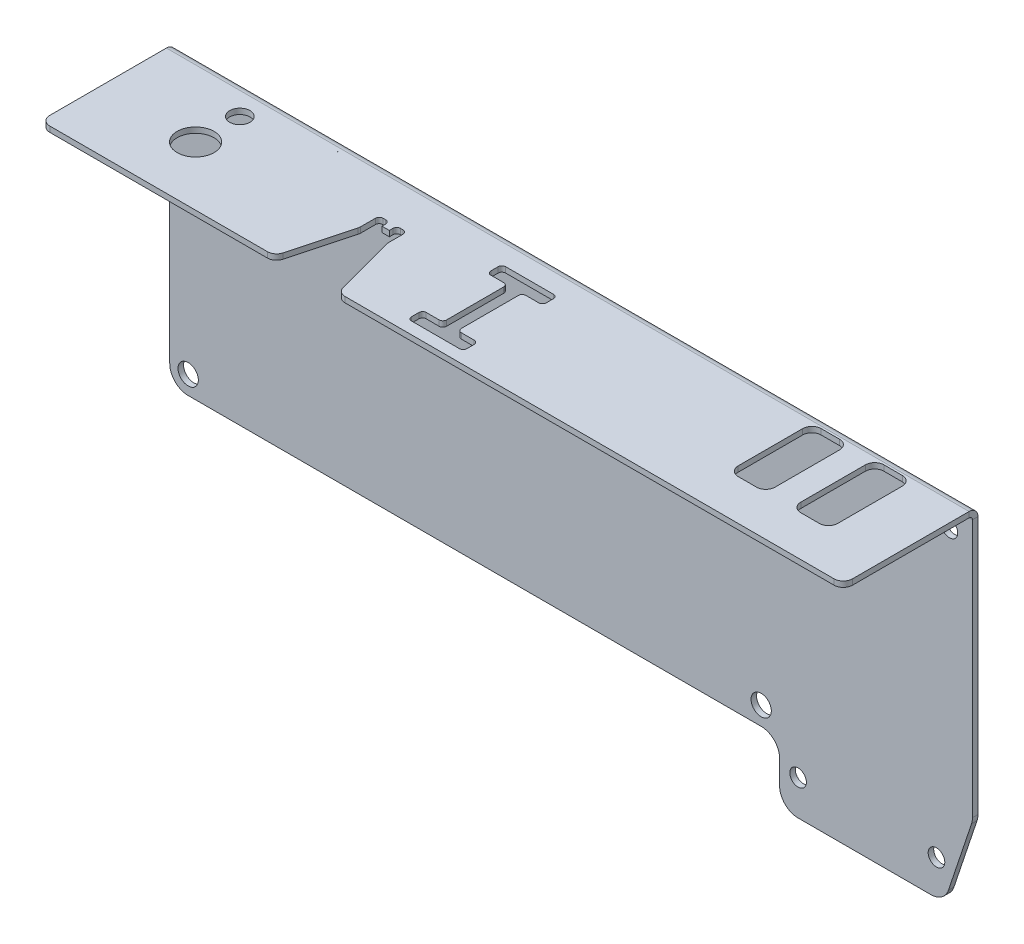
ISO-10303-21;
HEADER;
FILE_DESCRIPTION(('STEP AP214'),'2;1');
FILE_NAME('part.step','',(''),(''),'','','');
FILE_SCHEMA(('AUTOMOTIVE_DESIGN { 1 0 10303 214 1 1 1 1 }'));
ENDSEC;
DATA;
#1=APPLICATION_CONTEXT('core data for automotive mechanical design processes');
#2=APPLICATION_PROTOCOL_DEFINITION('international standard','automotive_design',2000,#1);
#3=PRODUCT_CONTEXT('',#1,'mechanical');
#4=PRODUCT('Part','Part','',(#3));
#5=PRODUCT_RELATED_PRODUCT_CATEGORY('part','',(#4));
#6=PRODUCT_DEFINITION_FORMATION('','',#4);
#7=PRODUCT_DEFINITION_CONTEXT('part definition',#1,'design');
#8=PRODUCT_DEFINITION('design','',#6,#7);
#9=PRODUCT_DEFINITION_SHAPE('','',#8);
#10=(LENGTH_UNIT() NAMED_UNIT(*) SI_UNIT(.MILLI.,.METRE.));
#11=(NAMED_UNIT(*) PLANE_ANGLE_UNIT() SI_UNIT($,.RADIAN.));
#12=(NAMED_UNIT(*) SI_UNIT($,.STERADIAN.) SOLID_ANGLE_UNIT());
#13=UNCERTAINTY_MEASURE_WITH_UNIT(LENGTH_MEASURE(1.E-05),#10,'distance_accuracy_value','');
#14=(GEOMETRIC_REPRESENTATION_CONTEXT(3) GLOBAL_UNCERTAINTY_ASSIGNED_CONTEXT((#13)) GLOBAL_UNIT_ASSIGNED_CONTEXT((#10,
#11,#12)) REPRESENTATION_CONTEXT('',''));
#15=CARTESIAN_POINT('',(0.,0.,0.));
#16=DIRECTION('',(0.,0.,1.));
#17=DIRECTION('',(1.,0.,0.));
#18=AXIS2_PLACEMENT_3D('',#15,#16,#17);
#19=CARTESIAN_POINT('',(320.499999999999,159.000000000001,-165.200000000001));
#20=DIRECTION('',(0.,1.,0.));
#21=DIRECTION('',(-1.,0.,0.));
#22=AXIS2_PLACEMENT_3D('',#19,#20,#21);
#23=PLANE('',#22);
#24=DIRECTION('',(-1.,0.,0.));
#25=VECTOR('',#24,1.);
#26=CARTESIAN_POINT('',(389.999999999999,158.999999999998,50.9999999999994));
#27=LINE('',#26,#25);
#28=CARTESIAN_POINT('',(399.999999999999,158.999999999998,50.9999999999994));
#29=VERTEX_POINT('',#28);
#30=CARTESIAN_POINT('',(389.999999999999,158.999999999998,50.9999999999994));
#31=VERTEX_POINT('',#30);
#32=EDGE_CURVE('E603',#29,#31,#27,.T.);
#33=ORIENTED_EDGE('',*,*,#32,.T.);
#34=CARTESIAN_POINT('',(389.999999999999,158.999999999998,45.9999999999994));
#35=DIRECTION('',(0.,-1.,0.));
#36=DIRECTION('',(-1.,0.,0.));
#37=AXIS2_PLACEMENT_3D('',#34,#35,#36);
#38=CIRCLE('',#37,5.00000000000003);
#39=CARTESIAN_POINT('',(384.999999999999,158.999999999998,45.9999999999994));
#40=VERTEX_POINT('',#39);
#41=EDGE_CURVE('E582',#31,#40,#38,.T.);
#42=ORIENTED_EDGE('',*,*,#41,.T.);
#43=DIRECTION('',(0.,0.,-1.));
#44=VECTOR('',#43,1.);
#45=CARTESIAN_POINT('',(384.999999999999,158.999999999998,45.9999999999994));
#46=LINE('',#45,#44);
#47=CARTESIAN_POINT('',(384.999999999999,158.999999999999,10.9999999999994));
#48=VERTEX_POINT('',#47);
#49=EDGE_CURVE('E585',#40,#48,#46,.T.);
#50=ORIENTED_EDGE('',*,*,#49,.T.);
#51=CARTESIAN_POINT('',(389.999999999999,158.999999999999,10.9999999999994));
#52=DIRECTION('',(0.,-1.,0.));
#53=DIRECTION('',(-1.,0.,0.));
#54=AXIS2_PLACEMENT_3D('',#51,#52,#53);
#55=CIRCLE('',#54,4.99999999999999);
#56=CARTESIAN_POINT('',(389.999999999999,158.999999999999,5.99999999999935));
#57=VERTEX_POINT('',#56);
#58=EDGE_CURVE('E588',#48,#57,#55,.T.);
#59=ORIENTED_EDGE('',*,*,#58,.T.);
#60=DIRECTION('',(1.,0.,0.));
#61=VECTOR('',#60,1.);
#62=CARTESIAN_POINT('',(389.999999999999,158.999999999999,5.99999999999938));
#63=LINE('',#62,#61);
#64=CARTESIAN_POINT('',(399.999999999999,158.999999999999,5.99999999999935));
#65=VERTEX_POINT('',#64);
#66=EDGE_CURVE('E591',#57,#65,#63,.T.);
#67=ORIENTED_EDGE('',*,*,#66,.T.);
#68=CARTESIAN_POINT('',(399.999999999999,158.999999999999,10.9999999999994));
#69=DIRECTION('',(0.,-1.,0.));
#70=DIRECTION('',(-1.,0.,0.));
#71=AXIS2_PLACEMENT_3D('',#68,#69,#70);
#72=CIRCLE('',#71,5.00000000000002);
#73=CARTESIAN_POINT('',(404.999999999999,158.999999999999,10.9999999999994));
#74=VERTEX_POINT('',#73);
#75=EDGE_CURVE('E594',#65,#74,#72,.T.);
#76=ORIENTED_EDGE('',*,*,#75,.T.);
#77=DIRECTION('',(0.,0.,1.));
#78=VECTOR('',#77,1.);
#79=CARTESIAN_POINT('',(404.999999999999,158.999999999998,45.9999999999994));
#80=LINE('',#79,#78);
#81=CARTESIAN_POINT('',(404.999999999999,158.999999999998,45.9999999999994));
#82=VERTEX_POINT('',#81);
#83=EDGE_CURVE('E597',#74,#82,#80,.T.);
#84=ORIENTED_EDGE('',*,*,#83,.T.);
#85=CARTESIAN_POINT('',(399.999999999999,158.999999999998,45.9999999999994));
#86=DIRECTION('',(0.,-1.,0.));
#87=DIRECTION('',(-1.,0.,0.));
#88=AXIS2_PLACEMENT_3D('',#85,#86,#87);
#89=CIRCLE('',#88,4.99999999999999);
#90=EDGE_CURVE('E600',#82,#29,#89,.T.);
#91=ORIENTED_EDGE('',*,*,#90,.T.);
#92=EDGE_LOOP('',(#33,#42,#50,#59,#67,#76,#84,#91));
#93=FACE_BOUND('',#92,.T.);
#94=CARTESIAN_POINT('',(51.9999999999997,158.999999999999,40.9999999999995));
#95=DIRECTION('',(0.,-1.,0.));
#96=DIRECTION('',(1.,0.,0.));
#97=AXIS2_PLACEMENT_3D('',#94,#95,#96);
#98=CIRCLE('',#97,10.);
#99=CARTESIAN_POINT('',(61.9999999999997,158.999999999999,40.9999999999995));
#100=VERTEX_POINT('',#99);
#101=EDGE_CURVE('E871',#100,#100,#98,.T.);
#102=ORIENTED_EDGE('',*,*,#101,.T.);
#103=EDGE_LOOP('',(#102));
#104=FACE_BOUND('',#103,.T.);
#105=CARTESIAN_POINT('',(51.9999999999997,159.,16.9999999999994));
#106=DIRECTION('',(0.,-1.,0.));
#107=DIRECTION('',(1.,0.,0.));
#108=AXIS2_PLACEMENT_3D('',#105,#106,#107);
#109=CIRCLE('',#108,5.5);
#110=CARTESIAN_POINT('',(57.4999999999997,159.,16.9999999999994));
#111=VERTEX_POINT('',#110);
#112=EDGE_CURVE('E877',#111,#111,#109,.T.);
#113=ORIENTED_EDGE('',*,*,#112,.T.);
#114=EDGE_LOOP('',(#113));
#115=FACE_BOUND('',#114,.T.);
#116=DIRECTION('',(0.,0.,1.));
#117=VECTOR('',#116,1.);
#118=CARTESIAN_POINT('',(211.5,158.999999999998,56.4999999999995));
#119=LINE('',#118,#117);
#120=CARTESIAN_POINT('',(211.5,158.999999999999,25.4999999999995));
#121=VERTEX_POINT('',#120);
#122=CARTESIAN_POINT('',(211.5,158.999999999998,56.4999999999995));
#123=VERTEX_POINT('',#122);
#124=EDGE_CURVE('E769',#121,#123,#119,.T.);
#125=ORIENTED_EDGE('',*,*,#124,.T.);
#126=CARTESIAN_POINT('',(213.5,158.999999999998,56.4999999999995));
#127=DIRECTION('',(0.,1.,0.));
#128=DIRECTION('',(-1.,0.,0.));
#129=AXIS2_PLACEMENT_3D('',#126,#127,#128);
#130=CIRCLE('',#129,2.);
#131=CARTESIAN_POINT('',(213.5,158.999999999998,58.4999999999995));
#132=VERTEX_POINT('',#131);
#133=EDGE_CURVE('E700',#123,#132,#130,.T.);
#134=ORIENTED_EDGE('',*,*,#133,.T.);
#135=DIRECTION('',(1.,0.,0.));
#136=VECTOR('',#135,1.);
#137=CARTESIAN_POINT('',(213.5,158.999999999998,58.4999999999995));
#138=LINE('',#137,#136);
#139=CARTESIAN_POINT('',(220.5,158.999999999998,58.4999999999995));
#140=VERTEX_POINT('',#139);
#141=EDGE_CURVE('E703',#132,#140,#138,.T.);
#142=ORIENTED_EDGE('',*,*,#141,.T.);
#143=CARTESIAN_POINT('',(220.5,158.999999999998,60.4999999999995));
#144=DIRECTION('',(0.,-1.,0.));
#145=DIRECTION('',(1.,0.,0.));
#146=AXIS2_PLACEMENT_3D('',#143,#144,#145);
#147=CIRCLE('',#146,1.99999999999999);
#148=CARTESIAN_POINT('',(222.5,158.999999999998,60.4999999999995));
#149=VERTEX_POINT('',#148);
#150=EDGE_CURVE('E706',#140,#149,#147,.T.);
#151=ORIENTED_EDGE('',*,*,#150,.T.);
#152=DIRECTION('',(0.,0.,1.));
#153=VECTOR('',#152,1.);
#154=CARTESIAN_POINT('',(222.5,158.999999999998,60.4999999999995));
#155=LINE('',#154,#153);
#156=CARTESIAN_POINT('',(222.5,158.999999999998,64.4999999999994));
#157=VERTEX_POINT('',#156);
#158=EDGE_CURVE('E709',#149,#157,#155,.T.);
#159=ORIENTED_EDGE('',*,*,#158,.T.);
#160=CARTESIAN_POINT('',(220.5,158.999999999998,64.4999999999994));
#161=DIRECTION('',(0.,-1.,0.));
#162=DIRECTION('',(1.,0.,0.));
#163=AXIS2_PLACEMENT_3D('',#160,#161,#162);
#164=CIRCLE('',#163,1.99999999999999);
#165=CARTESIAN_POINT('',(220.5,158.999999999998,66.4999999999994));
#166=VERTEX_POINT('',#165);
#167=EDGE_CURVE('E712',#157,#166,#164,.T.);
#168=ORIENTED_EDGE('',*,*,#167,.T.);
#169=DIRECTION('',(-1.,0.,0.));
#170=VECTOR('',#169,1.);
#171=CARTESIAN_POINT('',(194.5,158.999999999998,66.4999999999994));
#172=LINE('',#171,#170);
#173=CARTESIAN_POINT('',(194.5,158.999999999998,66.4999999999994));
#174=VERTEX_POINT('',#173);
#175=EDGE_CURVE('E715',#166,#174,#172,.T.);
#176=ORIENTED_EDGE('',*,*,#175,.T.);
#177=CARTESIAN_POINT('',(194.5,158.999999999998,64.4999999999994));
#178=DIRECTION('',(0.,-1.,0.));
#179=DIRECTION('',(1.,0.,0.));
#180=AXIS2_PLACEMENT_3D('',#177,#178,#179);
#181=CIRCLE('',#180,1.99999999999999);
#182=CARTESIAN_POINT('',(192.5,158.999999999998,64.4999999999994));
#183=VERTEX_POINT('',#182);
#184=EDGE_CURVE('E718',#174,#183,#181,.T.);
#185=ORIENTED_EDGE('',*,*,#184,.T.);
#186=DIRECTION('',(0.,0.,-1.));
#187=VECTOR('',#186,1.);
#188=CARTESIAN_POINT('',(192.5,158.999999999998,60.4999999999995));
#189=LINE('',#188,#187);
#190=CARTESIAN_POINT('',(192.5,158.999999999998,60.4999999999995));
#191=VERTEX_POINT('',#190);
#192=EDGE_CURVE('E721',#183,#191,#189,.T.);
#193=ORIENTED_EDGE('',*,*,#192,.T.);
#194=CARTESIAN_POINT('',(194.5,158.999999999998,60.4999999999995));
#195=DIRECTION('',(0.,-1.,0.));
#196=DIRECTION('',(1.,0.,0.));
#197=AXIS2_PLACEMENT_3D('',#194,#195,#196);
#198=CIRCLE('',#197,1.99999999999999);
#199=CARTESIAN_POINT('',(194.5,158.999999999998,58.4999999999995));
#200=VERTEX_POINT('',#199);
#201=EDGE_CURVE('E724',#191,#200,#198,.T.);
#202=ORIENTED_EDGE('',*,*,#201,.T.);
#203=DIRECTION('',(1.,0.,0.));
#204=VECTOR('',#203,1.);
#205=CARTESIAN_POINT('',(194.5,158.999999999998,58.4999999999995));
#206=LINE('',#205,#204);
#207=CARTESIAN_POINT('',(201.5,158.999999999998,58.4999999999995));
#208=VERTEX_POINT('',#207);
#209=EDGE_CURVE('E727',#200,#208,#206,.T.);
#210=ORIENTED_EDGE('',*,*,#209,.T.);
#211=CARTESIAN_POINT('',(201.5,158.999999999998,56.4999999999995));
#212=DIRECTION('',(0.,1.,0.));
#213=DIRECTION('',(-1.,0.,0.));
#214=AXIS2_PLACEMENT_3D('',#211,#212,#213);
#215=CIRCLE('',#214,2.);
#216=CARTESIAN_POINT('',(203.5,158.999999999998,56.4999999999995));
#217=VERTEX_POINT('',#216);
#218=EDGE_CURVE('E730',#208,#217,#215,.T.);
#219=ORIENTED_EDGE('',*,*,#218,.T.);
#220=DIRECTION('',(0.,0.,-1.));
#221=VECTOR('',#220,1.);
#222=CARTESIAN_POINT('',(203.5,158.999999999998,56.4999999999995));
#223=LINE('',#222,#221);
#224=CARTESIAN_POINT('',(203.5,158.999999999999,25.4999999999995));
#225=VERTEX_POINT('',#224);
#226=EDGE_CURVE('E733',#217,#225,#223,.T.);
#227=ORIENTED_EDGE('',*,*,#226,.T.);
#228=CARTESIAN_POINT('',(201.5,158.999999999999,25.4999999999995));
#229=DIRECTION('',(0.,1.,0.));
#230=DIRECTION('',(1.,0.,0.));
#231=AXIS2_PLACEMENT_3D('',#228,#229,#230);
#232=CIRCLE('',#231,2.);
#233=CARTESIAN_POINT('',(201.5,158.999999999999,23.4999999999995));
#234=VERTEX_POINT('',#233);
#235=EDGE_CURVE('E736',#225,#234,#232,.T.);
#236=ORIENTED_EDGE('',*,*,#235,.T.);
#237=DIRECTION('',(-1.,0.,0.));
#238=VECTOR('',#237,1.);
#239=CARTESIAN_POINT('',(194.5,158.999999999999,23.4999999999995));
#240=LINE('',#239,#238);
#241=CARTESIAN_POINT('',(194.5,158.999999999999,23.4999999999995));
#242=VERTEX_POINT('',#241);
#243=EDGE_CURVE('E739',#234,#242,#240,.T.);
#244=ORIENTED_EDGE('',*,*,#243,.T.);
#245=CARTESIAN_POINT('',(194.5,158.999999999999,21.4999999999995));
#246=DIRECTION('',(0.,-1.,0.));
#247=DIRECTION('',(-1.,0.,0.));
#248=AXIS2_PLACEMENT_3D('',#245,#246,#247);
#249=CIRCLE('',#248,1.99999999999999);
#250=CARTESIAN_POINT('',(192.5,158.999999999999,21.4999999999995));
#251=VERTEX_POINT('',#250);
#252=EDGE_CURVE('E742',#242,#251,#249,.T.);
#253=ORIENTED_EDGE('',*,*,#252,.T.);
#254=DIRECTION('',(0.,0.,-1.));
#255=VECTOR('',#254,1.);
#256=CARTESIAN_POINT('',(192.5,158.999999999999,21.4999999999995));
#257=LINE('',#256,#255);
#258=CARTESIAN_POINT('',(192.5,158.999999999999,17.4999999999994));
#259=VERTEX_POINT('',#258);
#260=EDGE_CURVE('E745',#251,#259,#257,.T.);
#261=ORIENTED_EDGE('',*,*,#260,.T.);
#262=CARTESIAN_POINT('',(194.5,158.999999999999,17.4999999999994));
#263=DIRECTION('',(0.,-1.,0.));
#264=DIRECTION('',(-1.,0.,0.));
#265=AXIS2_PLACEMENT_3D('',#262,#263,#264);
#266=CIRCLE('',#265,1.99999999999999);
#267=CARTESIAN_POINT('',(194.5,158.999999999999,15.4999999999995));
#268=VERTEX_POINT('',#267);
#269=EDGE_CURVE('E748',#259,#268,#266,.T.);
#270=ORIENTED_EDGE('',*,*,#269,.T.);
#271=DIRECTION('',(1.,0.,0.));
#272=VECTOR('',#271,1.);
#273=CARTESIAN_POINT('',(194.5,158.999999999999,15.4999999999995));
#274=LINE('',#273,#272);
#275=CARTESIAN_POINT('',(220.5,158.999999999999,15.4999999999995));
#276=VERTEX_POINT('',#275);
#277=EDGE_CURVE('E751',#268,#276,#274,.T.);
#278=ORIENTED_EDGE('',*,*,#277,.T.);
#279=CARTESIAN_POINT('',(220.5,158.999999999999,17.4999999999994));
#280=DIRECTION('',(0.,-1.,0.));
#281=DIRECTION('',(-1.,0.,0.));
#282=AXIS2_PLACEMENT_3D('',#279,#280,#281);
#283=CIRCLE('',#282,1.99999999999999);
#284=CARTESIAN_POINT('',(222.5,158.999999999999,17.4999999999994));
#285=VERTEX_POINT('',#284);
#286=EDGE_CURVE('E754',#276,#285,#283,.T.);
#287=ORIENTED_EDGE('',*,*,#286,.T.);
#288=DIRECTION('',(0.,0.,1.));
#289=VECTOR('',#288,1.);
#290=CARTESIAN_POINT('',(222.5,158.999999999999,21.4999999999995));
#291=LINE('',#290,#289);
#292=CARTESIAN_POINT('',(222.5,158.999999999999,21.4999999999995));
#293=VERTEX_POINT('',#292);
#294=EDGE_CURVE('E757',#285,#293,#291,.T.);
#295=ORIENTED_EDGE('',*,*,#294,.T.);
#296=CARTESIAN_POINT('',(220.5,158.999999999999,21.4999999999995));
#297=DIRECTION('',(0.,-1.,0.));
#298=DIRECTION('',(-1.,0.,0.));
#299=AXIS2_PLACEMENT_3D('',#296,#297,#298);
#300=CIRCLE('',#299,1.99999999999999);
#301=CARTESIAN_POINT('',(220.5,158.999999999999,23.4999999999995));
#302=VERTEX_POINT('',#301);
#303=EDGE_CURVE('E760',#293,#302,#300,.T.);
#304=ORIENTED_EDGE('',*,*,#303,.T.);
#305=DIRECTION('',(-1.,0.,0.));
#306=VECTOR('',#305,1.);
#307=CARTESIAN_POINT('',(213.5,158.999999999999,23.4999999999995));
#308=LINE('',#307,#306);
#309=CARTESIAN_POINT('',(213.5,158.999999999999,23.4999999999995));
#310=VERTEX_POINT('',#309);
#311=EDGE_CURVE('E763',#302,#310,#308,.T.);
#312=ORIENTED_EDGE('',*,*,#311,.T.);
#313=CARTESIAN_POINT('',(213.5,158.999999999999,25.4999999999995));
#314=DIRECTION('',(0.,1.,0.));
#315=DIRECTION('',(1.,0.,0.));
#316=AXIS2_PLACEMENT_3D('',#313,#314,#315);
#317=CIRCLE('',#316,2.);
#318=EDGE_CURVE('E766',#310,#121,#317,.T.);
#319=ORIENTED_EDGE('',*,*,#318,.T.);
#320=EDGE_LOOP('',(#125,#134,#142,#151,#159,#168,#176,#185,#193,#202,#210,#219,#227,#236,#244,
#253,#261,#270,#278,#287,#295,#304,#312,#319));
#321=FACE_BOUND('',#320,.T.);
#322=DIRECTION('',(-1.,0.,0.));
#323=VECTOR('',#322,1.);
#324=CARTESIAN_POINT('',(355.999999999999,158.999999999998,50.9999999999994));
#325=LINE('',#324,#323);
#326=CARTESIAN_POINT('',(365.999999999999,158.999999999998,50.9999999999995));
#327=VERTEX_POINT('',#326);
#328=CARTESIAN_POINT('',(355.999999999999,158.999999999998,50.9999999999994));
#329=VERTEX_POINT('',#328);
#330=EDGE_CURVE('E662',#327,#329,#325,.T.);
#331=ORIENTED_EDGE('',*,*,#330,.T.);
#332=CARTESIAN_POINT('',(355.999999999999,158.999999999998,45.9999999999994));
#333=DIRECTION('',(0.,-1.,0.));
#334=DIRECTION('',(-1.,0.,0.));
#335=AXIS2_PLACEMENT_3D('',#332,#333,#334);
#336=CIRCLE('',#335,5.);
#337=CARTESIAN_POINT('',(350.999999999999,158.999999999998,45.9999999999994));
#338=VERTEX_POINT('',#337);
#339=EDGE_CURVE('E641',#329,#338,#336,.T.);
#340=ORIENTED_EDGE('',*,*,#339,.T.);
#341=DIRECTION('',(0.,0.,-1.));
#342=VECTOR('',#341,1.);
#343=CARTESIAN_POINT('',(350.999999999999,158.999999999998,45.9999999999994));
#344=LINE('',#343,#342);
#345=CARTESIAN_POINT('',(350.999999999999,158.999999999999,10.9999999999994));
#346=VERTEX_POINT('',#345);
#347=EDGE_CURVE('E644',#338,#346,#344,.T.);
#348=ORIENTED_EDGE('',*,*,#347,.T.);
#349=CARTESIAN_POINT('',(355.999999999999,158.999999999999,10.9999999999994));
#350=DIRECTION('',(0.,-1.,0.));
#351=DIRECTION('',(-1.,0.,0.));
#352=AXIS2_PLACEMENT_3D('',#349,#350,#351);
#353=CIRCLE('',#352,5.00000000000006);
#354=CARTESIAN_POINT('',(355.999999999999,158.999999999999,5.99999999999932));
#355=VERTEX_POINT('',#354);
#356=EDGE_CURVE('E647',#346,#355,#353,.T.);
#357=ORIENTED_EDGE('',*,*,#356,.T.);
#358=DIRECTION('',(1.,0.,0.));
#359=VECTOR('',#358,1.);
#360=CARTESIAN_POINT('',(355.999999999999,158.999999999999,5.99999999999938));
#361=LINE('',#360,#359);
#362=CARTESIAN_POINT('',(365.999999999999,158.999999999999,5.99999999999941));
#363=VERTEX_POINT('',#362);
#364=EDGE_CURVE('E650',#355,#363,#361,.T.);
#365=ORIENTED_EDGE('',*,*,#364,.T.);
#366=CARTESIAN_POINT('',(365.999999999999,158.999999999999,10.9999999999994));
#367=DIRECTION('',(0.,-1.,0.));
#368=DIRECTION('',(-1.,0.,0.));
#369=AXIS2_PLACEMENT_3D('',#366,#367,#368);
#370=CIRCLE('',#369,4.99999999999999);
#371=CARTESIAN_POINT('',(370.999999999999,158.999999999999,10.9999999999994));
#372=VERTEX_POINT('',#371);
#373=EDGE_CURVE('E653',#363,#372,#370,.T.);
#374=ORIENTED_EDGE('',*,*,#373,.T.);
#375=DIRECTION('',(0.,0.,1.));
#376=VECTOR('',#375,1.);
#377=CARTESIAN_POINT('',(370.999999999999,158.999999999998,45.9999999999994));
#378=LINE('',#377,#376);
#379=CARTESIAN_POINT('',(370.999999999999,158.999999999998,45.9999999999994));
#380=VERTEX_POINT('',#379);
#381=EDGE_CURVE('E656',#372,#380,#378,.T.);
#382=ORIENTED_EDGE('',*,*,#381,.T.);
#383=CARTESIAN_POINT('',(365.999999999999,158.999999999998,45.9999999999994));
#384=DIRECTION('',(0.,-1.,0.));
#385=DIRECTION('',(-1.,0.,0.));
#386=AXIS2_PLACEMENT_3D('',#383,#384,#385);
#387=CIRCLE('',#386,5.00000000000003);
#388=EDGE_CURVE('E659',#380,#327,#387,.T.);
#389=ORIENTED_EDGE('',*,*,#388,.T.);
#390=EDGE_LOOP('',(#331,#340,#348,#357,#365,#374,#382,#389));
#391=FACE_BOUND('',#390,.T.);
#392=DIRECTION('',(0.,0.,1.));
#393=VECTOR('',#392,1.);
#394=CARTESIAN_POINT('',(434.999999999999,158.999999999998,67.9999999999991));
#395=LINE('',#394,#393);
#396=CARTESIAN_POINT('',(434.999999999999,158.999999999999,4.79999999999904));
#397=VERTEX_POINT('',#396);
#398=CARTESIAN_POINT('',(434.999999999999,158.999999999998,67.9999999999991));
#399=VERTEX_POINT('',#398);
#400=EDGE_CURVE('E883',#397,#399,#395,.T.);
#401=ORIENTED_EDGE('',*,*,#400,.F.);
#402=DIRECTION('',(-1.,0.,0.));
#403=VECTOR('',#402,1.);
#404=CARTESIAN_POINT('',(320.499999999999,158.999999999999,4.79999999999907));
#405=LINE('',#404,#403);
#406=CARTESIAN_POINT('',(-3.58879467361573E-13,159.,4.79999999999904));
#407=VERTEX_POINT('',#406);
#408=EDGE_CURVE('E53',#397,#407,#405,.T.);
#409=ORIENTED_EDGE('',*,*,#408,.T.);
#410=DIRECTION('',(0.,0.,-1.));
#411=VECTOR('',#410,1.);
#412=CARTESIAN_POINT('',(-3.51794449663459E-13,158.999999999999,67.9999999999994));
#413=LINE('',#412,#411);
#414=CARTESIAN_POINT('',(-3.51794449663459E-13,158.999999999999,67.9999999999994));
#415=VERTEX_POINT('',#414);
#416=EDGE_CURVE('E928',#415,#407,#413,.T.);
#417=ORIENTED_EDGE('',*,*,#416,.F.);
#418=CARTESIAN_POINT('',(4.99999999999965,158.999999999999,67.9999999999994));
#419=DIRECTION('',(0.,-1.,0.));
#420=DIRECTION('',(-1.,0.,0.));
#421=AXIS2_PLACEMENT_3D('',#418,#419,#420);
#422=CIRCLE('',#421,5.);
#423=CARTESIAN_POINT('',(4.99999999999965,158.999999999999,72.9999999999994));
#424=VERTEX_POINT('',#423);
#425=EDGE_CURVE('E926',#424,#415,#422,.T.);
#426=ORIENTED_EDGE('',*,*,#425,.F.);
#427=DIRECTION('',(-1.,0.,0.));
#428=VECTOR('',#427,1.);
#429=CARTESIAN_POINT('',(4.99999999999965,158.999999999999,72.9999999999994));
#430=LINE('',#429,#428);
#431=CARTESIAN_POINT('',(122.925625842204,158.999999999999,72.9999999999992));
#432=VERTEX_POINT('',#431);
#433=EDGE_CURVE('E924',#432,#424,#430,.T.);
#434=ORIENTED_EDGE('',*,*,#433,.F.);
#435=CARTESIAN_POINT('',(122.925625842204,158.999999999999,67.9999999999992));
#436=DIRECTION('',(0.,-1.,0.));
#437=DIRECTION('',(-1.,0.,0.));
#438=AXIS2_PLACEMENT_3D('',#435,#436,#437);
#439=CIRCLE('',#438,5.00000000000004);
#440=CARTESIAN_POINT('',(127.755254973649,158.999999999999,69.2940952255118));
#441=VERTEX_POINT('',#440);
#442=EDGE_CURVE('E922',#441,#432,#439,.T.);
#443=ORIENTED_EDGE('',*,*,#442,.F.);
#444=DIRECTION('',(-0.258819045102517,0.,0.965925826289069));
#445=VECTOR('',#444,1.);
#446=CARTESIAN_POINT('',(136.329629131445,158.999999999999,37.294095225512));
#447=LINE('',#446,#445);
#448=CARTESIAN_POINT('',(136.329629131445,158.999999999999,37.294095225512));
#449=VERTEX_POINT('',#448);
#450=EDGE_CURVE('E920',#449,#441,#447,.T.);
#451=ORIENTED_EDGE('',*,*,#450,.F.);
#452=CARTESIAN_POINT('',(131.5,158.999999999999,35.9999999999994));
#453=DIRECTION('',(0.,-1.,0.));
#454=DIRECTION('',(-1.,0.,0.));
#455=AXIS2_PLACEMENT_3D('',#452,#453,#454);
#456=CIRCLE('',#455,5.00000000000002);
#457=CARTESIAN_POINT('',(136.5,158.999999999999,35.9999999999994));
#458=VERTEX_POINT('',#457);
#459=EDGE_CURVE('E918',#458,#449,#456,.T.);
#460=ORIENTED_EDGE('',*,*,#459,.F.);
#461=DIRECTION('',(0.,0.,1.));
#462=VECTOR('',#461,1.);
#463=CARTESIAN_POINT('',(136.5,158.999999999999,35.9999999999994));
#464=LINE('',#463,#462);
#465=CARTESIAN_POINT('',(136.5,158.999999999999,27.9999999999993));
#466=VERTEX_POINT('',#465);
#467=EDGE_CURVE('E916',#466,#458,#464,.T.);
#468=ORIENTED_EDGE('',*,*,#467,.F.);
#469=CARTESIAN_POINT('',(138.5,158.999999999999,27.9999999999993));
#470=DIRECTION('',(0.,1.,0.));
#471=DIRECTION('',(-1.,0.,0.));
#472=AXIS2_PLACEMENT_3D('',#469,#470,#471);
#473=CIRCLE('',#472,2.);
#474=CARTESIAN_POINT('',(138.5,158.999999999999,25.9999999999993));
#475=VERTEX_POINT('',#474);
#476=EDGE_CURVE('E914',#475,#466,#473,.T.);
#477=ORIENTED_EDGE('',*,*,#476,.F.);
#478=DIRECTION('',(-1.,0.,0.));
#479=VECTOR('',#478,1.);
#480=CARTESIAN_POINT('',(138.5,158.999999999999,25.9999999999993));
#481=LINE('',#480,#479);
#482=CARTESIAN_POINT('',(140.,158.999999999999,25.9999999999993));
#483=VERTEX_POINT('',#482);
#484=EDGE_CURVE('E912',#483,#475,#481,.T.);
#485=ORIENTED_EDGE('',*,*,#484,.F.);
#486=CARTESIAN_POINT('',(140.,158.999999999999,27.9999999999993));
#487=DIRECTION('',(0.,1.,0.));
#488=DIRECTION('',(1.,0.,0.));
#489=AXIS2_PLACEMENT_3D('',#486,#487,#488);
#490=CIRCLE('',#489,2.00000000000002);
#491=CARTESIAN_POINT('',(142.,158.999999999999,27.9999999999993));
#492=VERTEX_POINT('',#491);
#493=EDGE_CURVE('E910',#492,#483,#490,.T.);
#494=ORIENTED_EDGE('',*,*,#493,.F.);
#495=DIRECTION('',(0.,0.,-1.));
#496=VECTOR('',#495,1.);
#497=CARTESIAN_POINT('',(142.,158.999999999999,27.9999999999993));
#498=LINE('',#497,#496);
#499=CARTESIAN_POINT('',(142.,158.999999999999,29.9999999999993));
#500=VERTEX_POINT('',#499);
#501=EDGE_CURVE('E908',#500,#492,#498,.T.);
#502=ORIENTED_EDGE('',*,*,#501,.F.);
#503=DIRECTION('',(-1.,0.,0.));
#504=VECTOR('',#503,1.);
#505=CARTESIAN_POINT('',(146.,158.999999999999,29.9999999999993));
#506=LINE('',#505,#504);
#507=CARTESIAN_POINT('',(146.,158.999999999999,29.9999999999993));
#508=VERTEX_POINT('',#507);
#509=EDGE_CURVE('E906',#508,#500,#506,.T.);
#510=ORIENTED_EDGE('',*,*,#509,.F.);
#511=DIRECTION('',(0.,0.,1.));
#512=VECTOR('',#511,1.);
#513=CARTESIAN_POINT('',(146.,158.999999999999,27.9999999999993));
#514=LINE('',#513,#512);
#515=CARTESIAN_POINT('',(146.,158.999999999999,27.9999999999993));
#516=VERTEX_POINT('',#515);
#517=EDGE_CURVE('E904',#516,#508,#514,.T.);
#518=ORIENTED_EDGE('',*,*,#517,.F.);
#519=CARTESIAN_POINT('',(148.,158.999999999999,27.9999999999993));
#520=DIRECTION('',(0.,1.,0.));
#521=DIRECTION('',(-1.,0.,0.));
#522=AXIS2_PLACEMENT_3D('',#519,#520,#521);
#523=CIRCLE('',#522,2.00000000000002);
#524=CARTESIAN_POINT('',(148.,158.999999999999,25.9999999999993));
#525=VERTEX_POINT('',#524);
#526=EDGE_CURVE('E902',#525,#516,#523,.T.);
#527=ORIENTED_EDGE('',*,*,#526,.F.);
#528=DIRECTION('',(-1.,0.,0.));
#529=VECTOR('',#528,1.);
#530=CARTESIAN_POINT('',(148.,158.999999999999,25.9999999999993));
#531=LINE('',#530,#529);
#532=CARTESIAN_POINT('',(149.5,158.999999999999,25.9999999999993));
#533=VERTEX_POINT('',#532);
#534=EDGE_CURVE('E900',#533,#525,#531,.T.);
#535=ORIENTED_EDGE('',*,*,#534,.F.);
#536=CARTESIAN_POINT('',(149.5,158.999999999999,27.9999999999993));
#537=DIRECTION('',(0.,1.,0.));
#538=DIRECTION('',(1.,0.,0.));
#539=AXIS2_PLACEMENT_3D('',#536,#537,#538);
#540=CIRCLE('',#539,2.);
#541=CARTESIAN_POINT('',(151.5,158.999999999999,27.9999999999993));
#542=VERTEX_POINT('',#541);
#543=EDGE_CURVE('E898',#542,#533,#540,.T.);
#544=ORIENTED_EDGE('',*,*,#543,.F.);
#545=DIRECTION('',(0.,0.,-1.));
#546=VECTOR('',#545,1.);
#547=CARTESIAN_POINT('',(151.5,158.999999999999,35.9999999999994));
#548=LINE('',#547,#546);
#549=CARTESIAN_POINT('',(151.5,158.999999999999,35.9999999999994));
#550=VERTEX_POINT('',#549);
#551=EDGE_CURVE('E896',#550,#542,#548,.T.);
#552=ORIENTED_EDGE('',*,*,#551,.F.);
#553=CARTESIAN_POINT('',(156.5,158.999999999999,35.9999999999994));
#554=DIRECTION('',(0.,-1.,0.));
#555=DIRECTION('',(1.,0.,0.));
#556=AXIS2_PLACEMENT_3D('',#553,#554,#555);
#557=CIRCLE('',#556,5.00000000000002);
#558=CARTESIAN_POINT('',(151.670370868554,158.999999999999,37.294095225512));
#559=VERTEX_POINT('',#558);
#560=EDGE_CURVE('E894',#559,#550,#557,.T.);
#561=ORIENTED_EDGE('',*,*,#560,.F.);
#562=DIRECTION('',(-0.258819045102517,0.,-0.965925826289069));
#563=VECTOR('',#562,1.);
#564=CARTESIAN_POINT('',(151.670370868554,158.999999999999,37.294095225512));
#565=LINE('',#564,#563);
#566=CARTESIAN_POINT('',(160.24474502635,158.999999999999,69.2940952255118));
#567=VERTEX_POINT('',#566);
#568=EDGE_CURVE('E892',#567,#559,#565,.T.);
#569=ORIENTED_EDGE('',*,*,#568,.F.);
#570=CARTESIAN_POINT('',(165.074374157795,158.999999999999,67.9999999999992));
#571=DIRECTION('',(0.,-1.,0.));
#572=DIRECTION('',(1.,0.,0.));
#573=AXIS2_PLACEMENT_3D('',#570,#571,#572);
#574=CIRCLE('',#573,5.00000000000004);
#575=CARTESIAN_POINT('',(165.074374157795,158.999999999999,72.9999999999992));
#576=VERTEX_POINT('',#575);
#577=EDGE_CURVE('E890',#576,#567,#574,.T.);
#578=ORIENTED_EDGE('',*,*,#577,.F.);
#579=DIRECTION('',(-1.,0.,0.));
#580=VECTOR('',#579,1.);
#581=CARTESIAN_POINT('',(165.074374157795,158.999999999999,72.9999999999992));
#582=LINE('',#581,#580);
#583=CARTESIAN_POINT('',(429.999999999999,158.999999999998,72.9999999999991));
#584=VERTEX_POINT('',#583);
#585=EDGE_CURVE('E888',#584,#576,#582,.T.);
#586=ORIENTED_EDGE('',*,*,#585,.F.);
#587=CARTESIAN_POINT('',(429.999999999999,158.999999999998,67.9999999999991));
#588=DIRECTION('',(0.,-1.,0.));
#589=DIRECTION('',(-1.,0.,0.));
#590=AXIS2_PLACEMENT_3D('',#587,#588,#589);
#591=CIRCLE('',#590,5.00000000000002);
#592=EDGE_CURVE('E885',#399,#584,#591,.T.);
#593=ORIENTED_EDGE('',*,*,#592,.F.);
#594=EDGE_LOOP('',(#401,#409,#417,#426,#434,#443,#451,#460,#468,#477,#485,#494,#502,#510,#518,
#527,#535,#544,#552,#561,#569,#578,#586,#593));
#595=FACE_BOUND('',#594,.T.);
#596=ADVANCED_FACE('F32',(#93,#104,#115,#321,#391,#595),#23,.T.);
#597=CARTESIAN_POINT('',(320.499999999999,156.000000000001,-165.200000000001));
#598=DIRECTION('',(0.,1.,0.));
#599=DIRECTION('',(-1.,0.,0.));
#600=AXIS2_PLACEMENT_3D('',#597,#598,#599);
#601=PLANE('',#600);
#602=DIRECTION('',(-1.,0.,0.));
#603=VECTOR('',#602,1.);
#604=CARTESIAN_POINT('',(320.499999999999,155.999999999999,4.79999999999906));
#605=LINE('',#604,#603);
#606=CARTESIAN_POINT('',(434.999999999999,155.999999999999,4.79999999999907));
#607=VERTEX_POINT('',#606);
#608=CARTESIAN_POINT('',(-3.5144376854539E-13,156.,4.79999999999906));
#609=VERTEX_POINT('',#608);
#610=EDGE_CURVE('E526',#607,#609,#605,.T.);
#611=ORIENTED_EDGE('',*,*,#610,.F.);
#612=DIRECTION('',(0.,0.,1.));
#613=VECTOR('',#612,1.);
#614=CARTESIAN_POINT('',(434.999999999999,155.999999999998,67.9999999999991));
#615=LINE('',#614,#613);
#616=CARTESIAN_POINT('',(434.999999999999,155.999999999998,67.9999999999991));
#617=VERTEX_POINT('',#616);
#618=EDGE_CURVE('E930',#607,#617,#615,.T.);
#619=ORIENTED_EDGE('',*,*,#618,.T.);
#620=CARTESIAN_POINT('',(429.999999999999,155.999999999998,67.9999999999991));
#621=DIRECTION('',(0.,-1.,0.));
#622=DIRECTION('',(-1.,0.,0.));
#623=AXIS2_PLACEMENT_3D('',#620,#621,#622);
#624=CIRCLE('',#623,5.00000000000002);
#625=CARTESIAN_POINT('',(429.999999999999,155.999999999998,72.9999999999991));
#626=VERTEX_POINT('',#625);
#627=EDGE_CURVE('E932',#617,#626,#624,.T.);
#628=ORIENTED_EDGE('',*,*,#627,.T.);
#629=DIRECTION('',(-1.,0.,0.));
#630=VECTOR('',#629,1.);
#631=CARTESIAN_POINT('',(180.,155.999999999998,72.9999999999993));
#632=LINE('',#631,#630);
#633=CARTESIAN_POINT('',(165.074374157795,155.999999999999,72.9999999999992));
#634=VERTEX_POINT('',#633);
#635=EDGE_CURVE('E934',#626,#634,#632,.T.);
#636=ORIENTED_EDGE('',*,*,#635,.T.);
#637=CARTESIAN_POINT('',(165.074374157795,155.999999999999,67.9999999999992));
#638=DIRECTION('',(0.,-1.,0.));
#639=DIRECTION('',(1.,0.,0.));
#640=AXIS2_PLACEMENT_3D('',#637,#638,#639);
#641=CIRCLE('',#640,5.00000000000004);
#642=CARTESIAN_POINT('',(160.24474502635,155.999999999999,69.2940952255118));
#643=VERTEX_POINT('',#642);
#644=EDGE_CURVE('E936',#634,#643,#641,.T.);
#645=ORIENTED_EDGE('',*,*,#644,.T.);
#646=DIRECTION('',(-0.258819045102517,0.,-0.965925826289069));
#647=VECTOR('',#646,1.);
#648=CARTESIAN_POINT('',(151.670370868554,155.999999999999,37.294095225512));
#649=LINE('',#648,#647);
#650=CARTESIAN_POINT('',(151.670370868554,155.999999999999,37.294095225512));
#651=VERTEX_POINT('',#650);
#652=EDGE_CURVE('E938',#643,#651,#649,.T.);
#653=ORIENTED_EDGE('',*,*,#652,.T.);
#654=CARTESIAN_POINT('',(156.5,155.999999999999,35.9999999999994));
#655=DIRECTION('',(0.,-1.,0.));
#656=DIRECTION('',(1.,0.,0.));
#657=AXIS2_PLACEMENT_3D('',#654,#655,#656);
#658=CIRCLE('',#657,5.00000000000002);
#659=CARTESIAN_POINT('',(151.5,155.999999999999,35.9999999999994));
#660=VERTEX_POINT('',#659);
#661=EDGE_CURVE('E940',#651,#660,#658,.T.);
#662=ORIENTED_EDGE('',*,*,#661,.T.);
#663=DIRECTION('',(0.,0.,-1.));
#664=VECTOR('',#663,1.);
#665=CARTESIAN_POINT('',(151.5,155.999999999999,35.9999999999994));
#666=LINE('',#665,#664);
#667=CARTESIAN_POINT('',(151.5,155.999999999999,27.9999999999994));
#668=VERTEX_POINT('',#667);
#669=EDGE_CURVE('E942',#660,#668,#666,.T.);
#670=ORIENTED_EDGE('',*,*,#669,.T.);
#671=CARTESIAN_POINT('',(149.5,155.999999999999,27.9999999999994));
#672=DIRECTION('',(0.,1.,0.));
#673=DIRECTION('',(1.,0.,0.));
#674=AXIS2_PLACEMENT_3D('',#671,#672,#673);
#675=CIRCLE('',#674,2.);
#676=CARTESIAN_POINT('',(149.5,155.999999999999,25.9999999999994));
#677=VERTEX_POINT('',#676);
#678=EDGE_CURVE('E944',#668,#677,#675,.T.);
#679=ORIENTED_EDGE('',*,*,#678,.T.);
#680=DIRECTION('',(-1.,0.,0.));
#681=VECTOR('',#680,1.);
#682=CARTESIAN_POINT('',(148.,155.999999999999,25.9999999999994));
#683=LINE('',#682,#681);
#684=CARTESIAN_POINT('',(148.,155.999999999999,25.9999999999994));
#685=VERTEX_POINT('',#684);
#686=EDGE_CURVE('E946',#677,#685,#683,.T.);
#687=ORIENTED_EDGE('',*,*,#686,.T.);
#688=CARTESIAN_POINT('',(148.,155.999999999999,27.9999999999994));
#689=DIRECTION('',(0.,1.,0.));
#690=DIRECTION('',(-1.,0.,0.));
#691=AXIS2_PLACEMENT_3D('',#688,#689,#690);
#692=CIRCLE('',#691,2.00000000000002);
#693=CARTESIAN_POINT('',(146.,155.999999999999,27.9999999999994));
#694=VERTEX_POINT('',#693);
#695=EDGE_CURVE('E948',#685,#694,#692,.T.);
#696=ORIENTED_EDGE('',*,*,#695,.T.);
#697=DIRECTION('',(0.,0.,1.));
#698=VECTOR('',#697,1.);
#699=CARTESIAN_POINT('',(146.,155.999999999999,27.9999999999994));
#700=LINE('',#699,#698);
#701=CARTESIAN_POINT('',(146.,155.999999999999,29.9999999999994));
#702=VERTEX_POINT('',#701);
#703=EDGE_CURVE('E950',#694,#702,#700,.T.);
#704=ORIENTED_EDGE('',*,*,#703,.T.);
#705=DIRECTION('',(-1.,0.,0.));
#706=VECTOR('',#705,1.);
#707=CARTESIAN_POINT('',(146.,155.999999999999,29.9999999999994));
#708=LINE('',#707,#706);
#709=CARTESIAN_POINT('',(142.,155.999999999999,29.9999999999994));
#710=VERTEX_POINT('',#709);
#711=EDGE_CURVE('E952',#702,#710,#708,.T.);
#712=ORIENTED_EDGE('',*,*,#711,.T.);
#713=DIRECTION('',(0.,0.,-1.));
#714=VECTOR('',#713,1.);
#715=CARTESIAN_POINT('',(142.,155.999999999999,27.9999999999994));
#716=LINE('',#715,#714);
#717=CARTESIAN_POINT('',(142.,155.999999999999,27.9999999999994));
#718=VERTEX_POINT('',#717);
#719=EDGE_CURVE('E954',#710,#718,#716,.T.);
#720=ORIENTED_EDGE('',*,*,#719,.T.);
#721=CARTESIAN_POINT('',(140.,155.999999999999,27.9999999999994));
#722=DIRECTION('',(0.,1.,0.));
#723=DIRECTION('',(1.,0.,0.));
#724=AXIS2_PLACEMENT_3D('',#721,#722,#723);
#725=CIRCLE('',#724,2.00000000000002);
#726=CARTESIAN_POINT('',(140.,155.999999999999,25.9999999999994));
#727=VERTEX_POINT('',#726);
#728=EDGE_CURVE('E956',#718,#727,#725,.T.);
#729=ORIENTED_EDGE('',*,*,#728,.T.);
#730=DIRECTION('',(-1.,0.,0.));
#731=VECTOR('',#730,1.);
#732=CARTESIAN_POINT('',(138.5,155.999999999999,25.9999999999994));
#733=LINE('',#732,#731);
#734=CARTESIAN_POINT('',(138.5,155.999999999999,25.9999999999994));
#735=VERTEX_POINT('',#734);
#736=EDGE_CURVE('E958',#727,#735,#733,.T.);
#737=ORIENTED_EDGE('',*,*,#736,.T.);
#738=CARTESIAN_POINT('',(138.5,155.999999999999,27.9999999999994));
#739=DIRECTION('',(0.,1.,0.));
#740=DIRECTION('',(-1.,0.,0.));
#741=AXIS2_PLACEMENT_3D('',#738,#739,#740);
#742=CIRCLE('',#741,2.);
#743=CARTESIAN_POINT('',(136.5,155.999999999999,27.9999999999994));
#744=VERTEX_POINT('',#743);
#745=EDGE_CURVE('E960',#735,#744,#742,.T.);
#746=ORIENTED_EDGE('',*,*,#745,.T.);
#747=DIRECTION('',(0.,0.,1.));
#748=VECTOR('',#747,1.);
#749=CARTESIAN_POINT('',(136.5,155.999999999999,35.9999999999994));
#750=LINE('',#749,#748);
#751=CARTESIAN_POINT('',(136.5,155.999999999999,35.9999999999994));
#752=VERTEX_POINT('',#751);
#753=EDGE_CURVE('E962',#744,#752,#750,.T.);
#754=ORIENTED_EDGE('',*,*,#753,.T.);
#755=CARTESIAN_POINT('',(131.5,155.999999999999,35.9999999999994));
#756=DIRECTION('',(0.,-1.,0.));
#757=DIRECTION('',(-1.,0.,0.));
#758=AXIS2_PLACEMENT_3D('',#755,#756,#757);
#759=CIRCLE('',#758,5.00000000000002);
#760=CARTESIAN_POINT('',(136.329629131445,155.999999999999,37.294095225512));
#761=VERTEX_POINT('',#760);
#762=EDGE_CURVE('E964',#752,#761,#759,.T.);
#763=ORIENTED_EDGE('',*,*,#762,.T.);
#764=DIRECTION('',(-0.258819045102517,0.,0.965925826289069));
#765=VECTOR('',#764,1.);
#766=CARTESIAN_POINT('',(136.329629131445,155.999999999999,37.294095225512));
#767=LINE('',#766,#765);
#768=CARTESIAN_POINT('',(127.755254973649,155.999999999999,69.2940952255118));
#769=VERTEX_POINT('',#768);
#770=EDGE_CURVE('E966',#761,#769,#767,.T.);
#771=ORIENTED_EDGE('',*,*,#770,.T.);
#772=CARTESIAN_POINT('',(122.925625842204,155.999999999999,67.9999999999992));
#773=DIRECTION('',(0.,-1.,0.));
#774=DIRECTION('',(-1.,0.,0.));
#775=AXIS2_PLACEMENT_3D('',#772,#773,#774);
#776=CIRCLE('',#775,5.00000000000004);
#777=CARTESIAN_POINT('',(122.925625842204,155.999999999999,72.9999999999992));
#778=VERTEX_POINT('',#777);
#779=EDGE_CURVE('E968',#769,#778,#776,.T.);
#780=ORIENTED_EDGE('',*,*,#779,.T.);
#781=DIRECTION('',(-1.,0.,0.));
#782=VECTOR('',#781,1.);
#783=CARTESIAN_POINT('',(4.99999999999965,155.999999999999,72.9999999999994));
#784=LINE('',#783,#782);
#785=CARTESIAN_POINT('',(4.99999999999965,155.999999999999,72.9999999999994));
#786=VERTEX_POINT('',#785);
#787=EDGE_CURVE('E970',#778,#786,#784,.T.);
#788=ORIENTED_EDGE('',*,*,#787,.T.);
#789=CARTESIAN_POINT('',(4.99999999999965,155.999999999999,67.9999999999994));
#790=DIRECTION('',(0.,-1.,0.));
#791=DIRECTION('',(-1.,0.,0.));
#792=AXIS2_PLACEMENT_3D('',#789,#790,#791);
#793=CIRCLE('',#792,5.);
#794=CARTESIAN_POINT('',(-3.44358750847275E-13,155.999999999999,67.9999999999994));
#795=VERTEX_POINT('',#794);
#796=EDGE_CURVE('E972',#786,#795,#793,.T.);
#797=ORIENTED_EDGE('',*,*,#796,.T.);
#798=DIRECTION('',(0.,0.,-1.));
#799=VECTOR('',#798,1.);
#800=CARTESIAN_POINT('',(-3.44358750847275E-13,155.999999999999,67.9999999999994));
#801=LINE('',#800,#799);
#802=EDGE_CURVE('E974',#795,#609,#801,.T.);
#803=ORIENTED_EDGE('',*,*,#802,.T.);
#804=EDGE_LOOP('',(#611,#619,#628,#636,#645,#653,#662,#670,#679,#687,#696,#704,#712,#720,#729,
#737,#746,#754,#763,#771,#780,#788,#797,#803));
#805=FACE_BOUND('',#804,.T.);
#806=CARTESIAN_POINT('',(355.999999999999,155.999999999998,45.9999999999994));
#807=DIRECTION('',(0.,-1.,0.));
#808=DIRECTION('',(-1.,0.,0.));
#809=AXIS2_PLACEMENT_3D('',#806,#807,#808);
#810=CIRCLE('',#809,5.);
#811=CARTESIAN_POINT('',(355.999999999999,155.999999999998,50.9999999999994));
#812=VERTEX_POINT('',#811);
#813=CARTESIAN_POINT('',(350.999999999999,155.999999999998,45.9999999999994));
#814=VERTEX_POINT('',#813);
#815=EDGE_CURVE('E665',#812,#814,#810,.T.);
#816=ORIENTED_EDGE('',*,*,#815,.F.);
#817=DIRECTION('',(-1.,0.,0.));
#818=VECTOR('',#817,1.);
#819=CARTESIAN_POINT('',(355.999999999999,155.999999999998,50.9999999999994));
#820=LINE('',#819,#818);
#821=CARTESIAN_POINT('',(365.999999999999,155.999999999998,50.9999999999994));
#822=VERTEX_POINT('',#821);
#823=EDGE_CURVE('E680',#822,#812,#820,.T.);
#824=ORIENTED_EDGE('',*,*,#823,.F.);
#825=CARTESIAN_POINT('',(365.999999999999,155.999999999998,45.9999999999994));
#826=DIRECTION('',(0.,-1.,0.));
#827=DIRECTION('',(-1.,0.,0.));
#828=AXIS2_PLACEMENT_3D('',#825,#826,#827);
#829=CIRCLE('',#828,5.00000000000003);
#830=CARTESIAN_POINT('',(370.999999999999,155.999999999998,45.9999999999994));
#831=VERTEX_POINT('',#830);
#832=EDGE_CURVE('E677',#831,#822,#829,.T.);
#833=ORIENTED_EDGE('',*,*,#832,.F.);
#834=DIRECTION('',(0.,0.,1.));
#835=VECTOR('',#834,1.);
#836=CARTESIAN_POINT('',(370.999999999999,155.999999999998,45.9999999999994));
#837=LINE('',#836,#835);
#838=CARTESIAN_POINT('',(370.999999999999,155.999999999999,10.9999999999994));
#839=VERTEX_POINT('',#838);
#840=EDGE_CURVE('E675',#839,#831,#837,.T.);
#841=ORIENTED_EDGE('',*,*,#840,.F.);
#842=CARTESIAN_POINT('',(365.999999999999,155.999999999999,10.9999999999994));
#843=DIRECTION('',(0.,-1.,0.));
#844=DIRECTION('',(-1.,0.,0.));
#845=AXIS2_PLACEMENT_3D('',#842,#843,#844);
#846=CIRCLE('',#845,4.99999999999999);
#847=CARTESIAN_POINT('',(365.999999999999,155.999999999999,5.99999999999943));
#848=VERTEX_POINT('',#847);
#849=EDGE_CURVE('E673',#848,#839,#846,.T.);
#850=ORIENTED_EDGE('',*,*,#849,.F.);
#851=DIRECTION('',(1.,0.,0.));
#852=VECTOR('',#851,1.);
#853=CARTESIAN_POINT('',(355.999999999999,155.999999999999,5.9999999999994));
#854=LINE('',#853,#852);
#855=CARTESIAN_POINT('',(355.999999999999,155.999999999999,5.99999999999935));
#856=VERTEX_POINT('',#855);
#857=EDGE_CURVE('E671',#856,#848,#854,.T.);
#858=ORIENTED_EDGE('',*,*,#857,.F.);
#859=CARTESIAN_POINT('',(355.999999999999,155.999999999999,10.9999999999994));
#860=DIRECTION('',(0.,-1.,0.));
#861=DIRECTION('',(-1.,0.,0.));
#862=AXIS2_PLACEMENT_3D('',#859,#860,#861);
#863=CIRCLE('',#862,5.00000000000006);
#864=CARTESIAN_POINT('',(350.999999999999,155.999999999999,10.9999999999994));
#865=VERTEX_POINT('',#864);
#866=EDGE_CURVE('E669',#865,#856,#863,.T.);
#867=ORIENTED_EDGE('',*,*,#866,.F.);
#868=DIRECTION('',(0.,0.,-1.));
#869=VECTOR('',#868,1.);
#870=CARTESIAN_POINT('',(350.999999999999,155.999999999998,45.9999999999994));
#871=LINE('',#870,#869);
#872=EDGE_CURVE('E667',#814,#865,#871,.T.);
#873=ORIENTED_EDGE('',*,*,#872,.F.);
#874=EDGE_LOOP('',(#816,#824,#833,#841,#850,#858,#867,#873));
#875=FACE_BOUND('',#874,.T.);
#876=CARTESIAN_POINT('',(213.5,155.999999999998,56.4999999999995));
#877=DIRECTION('',(0.,1.,0.));
#878=DIRECTION('',(-1.,0.,0.));
#879=AXIS2_PLACEMENT_3D('',#876,#877,#878);
#880=CIRCLE('',#879,2.);
#881=CARTESIAN_POINT('',(211.5,155.999999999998,56.4999999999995));
#882=VERTEX_POINT('',#881);
#883=CARTESIAN_POINT('',(213.5,155.999999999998,58.4999999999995));
#884=VERTEX_POINT('',#883);
#885=EDGE_CURVE('E772',#882,#884,#880,.T.);
#886=ORIENTED_EDGE('',*,*,#885,.F.);
#887=DIRECTION('',(0.,0.,1.));
#888=VECTOR('',#887,1.);
#889=CARTESIAN_POINT('',(211.5,155.999999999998,56.4999999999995));
#890=LINE('',#889,#888);
#891=CARTESIAN_POINT('',(211.5,155.999999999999,25.4999999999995));
#892=VERTEX_POINT('',#891);
#893=EDGE_CURVE('E819',#892,#882,#890,.T.);
#894=ORIENTED_EDGE('',*,*,#893,.F.);
#895=CARTESIAN_POINT('',(213.5,155.999999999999,25.4999999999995));
#896=DIRECTION('',(0.,1.,0.));
#897=DIRECTION('',(1.,0.,0.));
#898=AXIS2_PLACEMENT_3D('',#895,#896,#897);
#899=CIRCLE('',#898,2.);
#900=CARTESIAN_POINT('',(213.5,155.999999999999,23.4999999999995));
#901=VERTEX_POINT('',#900);
#902=EDGE_CURVE('E816',#901,#892,#899,.T.);
#903=ORIENTED_EDGE('',*,*,#902,.F.);
#904=DIRECTION('',(-1.,0.,0.));
#905=VECTOR('',#904,1.);
#906=CARTESIAN_POINT('',(213.5,155.999999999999,23.4999999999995));
#907=LINE('',#906,#905);
#908=CARTESIAN_POINT('',(220.5,155.999999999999,23.4999999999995));
#909=VERTEX_POINT('',#908);
#910=EDGE_CURVE('E814',#909,#901,#907,.T.);
#911=ORIENTED_EDGE('',*,*,#910,.F.);
#912=CARTESIAN_POINT('',(220.5,155.999999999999,21.4999999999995));
#913=DIRECTION('',(0.,-1.,0.));
#914=DIRECTION('',(-1.,0.,0.));
#915=AXIS2_PLACEMENT_3D('',#912,#913,#914);
#916=CIRCLE('',#915,1.99999999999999);
#917=CARTESIAN_POINT('',(222.5,155.999999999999,21.4999999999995));
#918=VERTEX_POINT('',#917);
#919=EDGE_CURVE('E812',#918,#909,#916,.T.);
#920=ORIENTED_EDGE('',*,*,#919,.F.);
#921=DIRECTION('',(0.,0.,1.));
#922=VECTOR('',#921,1.);
#923=CARTESIAN_POINT('',(222.5,155.999999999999,21.4999999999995));
#924=LINE('',#923,#922);
#925=CARTESIAN_POINT('',(222.5,155.999999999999,17.4999999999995));
#926=VERTEX_POINT('',#925);
#927=EDGE_CURVE('E810',#926,#918,#924,.T.);
#928=ORIENTED_EDGE('',*,*,#927,.F.);
#929=CARTESIAN_POINT('',(220.5,155.999999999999,17.4999999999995));
#930=DIRECTION('',(0.,-1.,0.));
#931=DIRECTION('',(-1.,0.,0.));
#932=AXIS2_PLACEMENT_3D('',#929,#930,#931);
#933=CIRCLE('',#932,1.99999999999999);
#934=CARTESIAN_POINT('',(220.5,155.999999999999,15.4999999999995));
#935=VERTEX_POINT('',#934);
#936=EDGE_CURVE('E808',#935,#926,#933,.T.);
#937=ORIENTED_EDGE('',*,*,#936,.F.);
#938=DIRECTION('',(1.,0.,0.));
#939=VECTOR('',#938,1.);
#940=CARTESIAN_POINT('',(194.5,155.999999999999,15.4999999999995));
#941=LINE('',#940,#939);
#942=CARTESIAN_POINT('',(194.5,155.999999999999,15.4999999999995));
#943=VERTEX_POINT('',#942);
#944=EDGE_CURVE('E806',#943,#935,#941,.T.);
#945=ORIENTED_EDGE('',*,*,#944,.F.);
#946=CARTESIAN_POINT('',(194.5,155.999999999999,17.4999999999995));
#947=DIRECTION('',(0.,-1.,0.));
#948=DIRECTION('',(-1.,0.,0.));
#949=AXIS2_PLACEMENT_3D('',#946,#947,#948);
#950=CIRCLE('',#949,1.99999999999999);
#951=CARTESIAN_POINT('',(192.5,155.999999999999,17.4999999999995));
#952=VERTEX_POINT('',#951);
#953=EDGE_CURVE('E804',#952,#943,#950,.T.);
#954=ORIENTED_EDGE('',*,*,#953,.F.);
#955=DIRECTION('',(0.,0.,-1.));
#956=VECTOR('',#955,1.);
#957=CARTESIAN_POINT('',(192.5,155.999999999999,21.4999999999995));
#958=LINE('',#957,#956);
#959=CARTESIAN_POINT('',(192.5,155.999999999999,21.4999999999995));
#960=VERTEX_POINT('',#959);
#961=EDGE_CURVE('E802',#960,#952,#958,.T.);
#962=ORIENTED_EDGE('',*,*,#961,.F.);
#963=CARTESIAN_POINT('',(194.5,155.999999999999,21.4999999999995));
#964=DIRECTION('',(0.,-1.,0.));
#965=DIRECTION('',(-1.,0.,0.));
#966=AXIS2_PLACEMENT_3D('',#963,#964,#965);
#967=CIRCLE('',#966,1.99999999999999);
#968=CARTESIAN_POINT('',(194.5,155.999999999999,23.4999999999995));
#969=VERTEX_POINT('',#968);
#970=EDGE_CURVE('E800',#969,#960,#967,.T.);
#971=ORIENTED_EDGE('',*,*,#970,.F.);
#972=DIRECTION('',(-1.,0.,0.));
#973=VECTOR('',#972,1.);
#974=CARTESIAN_POINT('',(194.5,155.999999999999,23.4999999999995));
#975=LINE('',#974,#973);
#976=CARTESIAN_POINT('',(201.5,155.999999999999,23.4999999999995));
#977=VERTEX_POINT('',#976);
#978=EDGE_CURVE('E798',#977,#969,#975,.T.);
#979=ORIENTED_EDGE('',*,*,#978,.F.);
#980=CARTESIAN_POINT('',(201.5,155.999999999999,25.4999999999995));
#981=DIRECTION('',(0.,1.,0.));
#982=DIRECTION('',(1.,0.,0.));
#983=AXIS2_PLACEMENT_3D('',#980,#981,#982);
#984=CIRCLE('',#983,2.);
#985=CARTESIAN_POINT('',(203.5,155.999999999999,25.4999999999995));
#986=VERTEX_POINT('',#985);
#987=EDGE_CURVE('E796',#986,#977,#984,.T.);
#988=ORIENTED_EDGE('',*,*,#987,.F.);
#989=DIRECTION('',(0.,0.,-1.));
#990=VECTOR('',#989,1.);
#991=CARTESIAN_POINT('',(203.5,155.999999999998,56.4999999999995));
#992=LINE('',#991,#990);
#993=CARTESIAN_POINT('',(203.5,155.999999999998,56.4999999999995));
#994=VERTEX_POINT('',#993);
#995=EDGE_CURVE('E794',#994,#986,#992,.T.);
#996=ORIENTED_EDGE('',*,*,#995,.F.);
#997=CARTESIAN_POINT('',(201.5,155.999999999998,56.4999999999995));
#998=DIRECTION('',(0.,1.,0.));
#999=DIRECTION('',(-1.,0.,0.));
#1000=AXIS2_PLACEMENT_3D('',#997,#998,#999);
#1001=CIRCLE('',#1000,2.);
#1002=CARTESIAN_POINT('',(201.5,155.999999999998,58.4999999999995));
#1003=VERTEX_POINT('',#1002);
#1004=EDGE_CURVE('E792',#1003,#994,#1001,.T.);
#1005=ORIENTED_EDGE('',*,*,#1004,.F.);
#1006=DIRECTION('',(1.,0.,0.));
#1007=VECTOR('',#1006,1.);
#1008=CARTESIAN_POINT('',(194.5,155.999999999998,58.4999999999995));
#1009=LINE('',#1008,#1007);
#1010=CARTESIAN_POINT('',(194.5,155.999999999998,58.4999999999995));
#1011=VERTEX_POINT('',#1010);
#1012=EDGE_CURVE('E790',#1011,#1003,#1009,.T.);
#1013=ORIENTED_EDGE('',*,*,#1012,.F.);
#1014=CARTESIAN_POINT('',(194.5,155.999999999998,60.4999999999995));
#1015=DIRECTION('',(0.,-1.,0.));
#1016=DIRECTION('',(1.,0.,0.));
#1017=AXIS2_PLACEMENT_3D('',#1014,#1015,#1016);
#1018=CIRCLE('',#1017,1.99999999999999);
#1019=CARTESIAN_POINT('',(192.5,155.999999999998,60.4999999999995));
#1020=VERTEX_POINT('',#1019);
#1021=EDGE_CURVE('E788',#1020,#1011,#1018,.T.);
#1022=ORIENTED_EDGE('',*,*,#1021,.F.);
#1023=DIRECTION('',(0.,0.,-1.));
#1024=VECTOR('',#1023,1.);
#1025=CARTESIAN_POINT('',(192.5,155.999999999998,60.4999999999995));
#1026=LINE('',#1025,#1024);
#1027=CARTESIAN_POINT('',(192.5,155.999999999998,64.4999999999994));
#1028=VERTEX_POINT('',#1027);
#1029=EDGE_CURVE('E786',#1028,#1020,#1026,.T.);
#1030=ORIENTED_EDGE('',*,*,#1029,.F.);
#1031=CARTESIAN_POINT('',(194.5,155.999999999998,64.4999999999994));
#1032=DIRECTION('',(0.,-1.,0.));
#1033=DIRECTION('',(1.,0.,0.));
#1034=AXIS2_PLACEMENT_3D('',#1031,#1032,#1033);
#1035=CIRCLE('',#1034,1.99999999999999);
#1036=CARTESIAN_POINT('',(194.5,155.999999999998,66.4999999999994));
#1037=VERTEX_POINT('',#1036);
#1038=EDGE_CURVE('E784',#1037,#1028,#1035,.T.);
#1039=ORIENTED_EDGE('',*,*,#1038,.F.);
#1040=DIRECTION('',(-1.,0.,0.));
#1041=VECTOR('',#1040,1.);
#1042=CARTESIAN_POINT('',(194.5,155.999999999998,66.4999999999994));
#1043=LINE('',#1042,#1041);
#1044=CARTESIAN_POINT('',(220.5,155.999999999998,66.4999999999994));
#1045=VERTEX_POINT('',#1044);
#1046=EDGE_CURVE('E782',#1045,#1037,#1043,.T.);
#1047=ORIENTED_EDGE('',*,*,#1046,.F.);
#1048=CARTESIAN_POINT('',(220.5,155.999999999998,64.4999999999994));
#1049=DIRECTION('',(0.,-1.,0.));
#1050=DIRECTION('',(1.,0.,0.));
#1051=AXIS2_PLACEMENT_3D('',#1048,#1049,#1050);
#1052=CIRCLE('',#1051,1.99999999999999);
#1053=CARTESIAN_POINT('',(222.5,155.999999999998,64.4999999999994));
#1054=VERTEX_POINT('',#1053);
#1055=EDGE_CURVE('E780',#1054,#1045,#1052,.T.);
#1056=ORIENTED_EDGE('',*,*,#1055,.F.);
#1057=DIRECTION('',(0.,0.,1.));
#1058=VECTOR('',#1057,1.);
#1059=CARTESIAN_POINT('',(222.5,155.999999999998,60.4999999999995));
#1060=LINE('',#1059,#1058);
#1061=CARTESIAN_POINT('',(222.5,155.999999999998,60.4999999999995));
#1062=VERTEX_POINT('',#1061);
#1063=EDGE_CURVE('E778',#1062,#1054,#1060,.T.);
#1064=ORIENTED_EDGE('',*,*,#1063,.F.);
#1065=CARTESIAN_POINT('',(220.5,155.999999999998,60.4999999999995));
#1066=DIRECTION('',(0.,-1.,0.));
#1067=DIRECTION('',(1.,0.,0.));
#1068=AXIS2_PLACEMENT_3D('',#1065,#1066,#1067);
#1069=CIRCLE('',#1068,1.99999999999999);
#1070=CARTESIAN_POINT('',(220.5,155.999999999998,58.4999999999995));
#1071=VERTEX_POINT('',#1070);
#1072=EDGE_CURVE('E776',#1071,#1062,#1069,.T.);
#1073=ORIENTED_EDGE('',*,*,#1072,.F.);
#1074=DIRECTION('',(1.,0.,0.));
#1075=VECTOR('',#1074,1.);
#1076=CARTESIAN_POINT('',(213.5,155.999999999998,58.4999999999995));
#1077=LINE('',#1076,#1075);
#1078=EDGE_CURVE('E774',#884,#1071,#1077,.T.);
#1079=ORIENTED_EDGE('',*,*,#1078,.F.);
#1080=EDGE_LOOP('',(#886,#894,#903,#911,#920,#928,#937,#945,#954,#962,#971,#979,#988,#996,#1005,
#1013,#1022,#1030,#1039,#1047,#1056,#1064,#1073,#1079));
#1081=FACE_BOUND('',#1080,.T.);
#1082=CARTESIAN_POINT('',(51.9999999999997,156.,16.9999999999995));
#1083=DIRECTION('',(0.,-1.,0.));
#1084=DIRECTION('',(1.,0.,0.));
#1085=AXIS2_PLACEMENT_3D('',#1082,#1083,#1084);
#1086=CIRCLE('',#1085,5.5);
#1087=CARTESIAN_POINT('',(57.4999999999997,156.,16.9999999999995));
#1088=VERTEX_POINT('',#1087);
#1089=EDGE_CURVE('E880',#1088,#1088,#1086,.T.);
#1090=ORIENTED_EDGE('',*,*,#1089,.F.);
#1091=EDGE_LOOP('',(#1090));
#1092=FACE_BOUND('',#1091,.T.);
#1093=CARTESIAN_POINT('',(51.9999999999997,155.999999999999,40.9999999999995));
#1094=DIRECTION('',(0.,-1.,0.));
#1095=DIRECTION('',(1.,0.,0.));
#1096=AXIS2_PLACEMENT_3D('',#1093,#1094,#1095);
#1097=CIRCLE('',#1096,10.);
#1098=CARTESIAN_POINT('',(61.9999999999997,155.999999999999,40.9999999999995));
#1099=VERTEX_POINT('',#1098);
#1100=EDGE_CURVE('E874',#1099,#1099,#1097,.T.);
#1101=ORIENTED_EDGE('',*,*,#1100,.F.);
#1102=EDGE_LOOP('',(#1101));
#1103=FACE_BOUND('',#1102,.T.);
#1104=CARTESIAN_POINT('',(389.999999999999,155.999999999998,45.9999999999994));
#1105=DIRECTION('',(0.,-1.,0.));
#1106=DIRECTION('',(-1.,0.,0.));
#1107=AXIS2_PLACEMENT_3D('',#1104,#1105,#1106);
#1108=CIRCLE('',#1107,5.00000000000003);
#1109=CARTESIAN_POINT('',(389.999999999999,155.999999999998,50.9999999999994));
#1110=VERTEX_POINT('',#1109);
#1111=CARTESIAN_POINT('',(384.999999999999,155.999999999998,45.9999999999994));
#1112=VERTEX_POINT('',#1111);
#1113=EDGE_CURVE('E606',#1110,#1112,#1108,.T.);
#1114=ORIENTED_EDGE('',*,*,#1113,.F.);
#1115=DIRECTION('',(-1.,0.,0.));
#1116=VECTOR('',#1115,1.);
#1117=CARTESIAN_POINT('',(389.999999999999,155.999999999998,50.9999999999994));
#1118=LINE('',#1117,#1116);
#1119=CARTESIAN_POINT('',(399.999999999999,155.999999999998,50.9999999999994));
#1120=VERTEX_POINT('',#1119);
#1121=EDGE_CURVE('E621',#1120,#1110,#1118,.T.);
#1122=ORIENTED_EDGE('',*,*,#1121,.F.);
#1123=CARTESIAN_POINT('',(399.999999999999,155.999999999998,45.9999999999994));
#1124=DIRECTION('',(0.,-1.,0.));
#1125=DIRECTION('',(-1.,0.,0.));
#1126=AXIS2_PLACEMENT_3D('',#1123,#1124,#1125);
#1127=CIRCLE('',#1126,4.99999999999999);
#1128=CARTESIAN_POINT('',(404.999999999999,155.999999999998,45.9999999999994));
#1129=VERTEX_POINT('',#1128);
#1130=EDGE_CURVE('E618',#1129,#1120,#1127,.T.);
#1131=ORIENTED_EDGE('',*,*,#1130,.F.);
#1132=DIRECTION('',(0.,0.,1.));
#1133=VECTOR('',#1132,1.);
#1134=CARTESIAN_POINT('',(404.999999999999,155.999999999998,45.9999999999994));
#1135=LINE('',#1134,#1133);
#1136=CARTESIAN_POINT('',(404.999999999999,155.999999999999,10.9999999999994));
#1137=VERTEX_POINT('',#1136);
#1138=EDGE_CURVE('E616',#1137,#1129,#1135,.T.);
#1139=ORIENTED_EDGE('',*,*,#1138,.F.);
#1140=CARTESIAN_POINT('',(399.999999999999,155.999999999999,10.9999999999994));
#1141=DIRECTION('',(0.,-1.,0.));
#1142=DIRECTION('',(-1.,0.,0.));
#1143=AXIS2_PLACEMENT_3D('',#1140,#1141,#1142);
#1144=CIRCLE('',#1143,5.00000000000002);
#1145=CARTESIAN_POINT('',(399.999999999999,155.999999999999,5.99999999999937));
#1146=VERTEX_POINT('',#1145);
#1147=EDGE_CURVE('E614',#1146,#1137,#1144,.T.);
#1148=ORIENTED_EDGE('',*,*,#1147,.F.);
#1149=DIRECTION('',(1.,0.,0.));
#1150=VECTOR('',#1149,1.);
#1151=CARTESIAN_POINT('',(389.999999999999,155.999999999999,5.9999999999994));
#1152=LINE('',#1151,#1150);
#1153=CARTESIAN_POINT('',(389.999999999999,155.999999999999,5.99999999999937));
#1154=VERTEX_POINT('',#1153);
#1155=EDGE_CURVE('E612',#1154,#1146,#1152,.T.);
#1156=ORIENTED_EDGE('',*,*,#1155,.F.);
#1157=CARTESIAN_POINT('',(389.999999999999,155.999999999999,10.9999999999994));
#1158=DIRECTION('',(0.,-1.,0.));
#1159=DIRECTION('',(-1.,0.,0.));
#1160=AXIS2_PLACEMENT_3D('',#1157,#1158,#1159);
#1161=CIRCLE('',#1160,4.99999999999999);
#1162=CARTESIAN_POINT('',(384.999999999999,155.999999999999,10.9999999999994));
#1163=VERTEX_POINT('',#1162);
#1164=EDGE_CURVE('E610',#1163,#1154,#1161,.T.);
#1165=ORIENTED_EDGE('',*,*,#1164,.F.);
#1166=DIRECTION('',(0.,0.,-1.));
#1167=VECTOR('',#1166,1.);
#1168=CARTESIAN_POINT('',(384.999999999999,155.999999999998,45.9999999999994));
#1169=LINE('',#1168,#1167);
#1170=EDGE_CURVE('E608',#1112,#1163,#1169,.T.);
#1171=ORIENTED_EDGE('',*,*,#1170,.F.);
#1172=EDGE_LOOP('',(#1114,#1122,#1131,#1139,#1148,#1156,#1165,#1171));
#1173=FACE_BOUND('',#1172,.T.);
#1174=ADVANCED_FACE('F1178',(#805,#875,#1081,#1092,#1103,#1173),#601,.F.);
#1175=CARTESIAN_POINT('',(434.999999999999,155.999999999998,67.9999999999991));
#1176=DIRECTION('',(-1.,0.,0.));
#1177=DIRECTION('',(0.,0.,-1.));
#1178=AXIS2_PLACEMENT_3D('',#1175,#1176,#1177);
#1179=PLANE('',#1178);
#1180=DIRECTION('',(0.,-1.,0.));
#1181=VECTOR('',#1180,1.);
#1182=CARTESIAN_POINT('',(434.999999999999,155.999999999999,4.79999999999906));
#1183=LINE('',#1182,#1181);
#1184=EDGE_CURVE('E40',#397,#607,#1183,.T.);
#1185=ORIENTED_EDGE('',*,*,#1184,.F.);
#1186=ORIENTED_EDGE('',*,*,#400,.T.);
#1187=DIRECTION('',(0.,1.,0.));
#1188=VECTOR('',#1187,1.);
#1189=CARTESIAN_POINT('',(434.999999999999,155.999999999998,67.9999999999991));
#1190=LINE('',#1189,#1188);
#1191=EDGE_CURVE('E1040',#617,#399,#1190,.T.);
#1192=ORIENTED_EDGE('',*,*,#1191,.F.);
#1193=ORIENTED_EDGE('',*,*,#618,.F.);
#1194=EDGE_LOOP('',(#1185,#1186,#1192,#1193));
#1195=FACE_BOUND('',#1194,.T.);
#1196=ADVANCED_FACE('F34',(#1195),#1179,.F.);
#1197=CARTESIAN_POINT('',(429.999999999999,155.999999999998,67.9999999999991));
#1198=DIRECTION('',(0.,1.,0.));
#1199=DIRECTION('',(-1.,0.,0.));
#1200=AXIS2_PLACEMENT_3D('',#1197,#1198,#1199);
#1201=CYLINDRICAL_SURFACE('',#1200,5.00000000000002);
#1202=ORIENTED_EDGE('',*,*,#592,.T.);
#1203=DIRECTION('',(0.,1.,0.));
#1204=VECTOR('',#1203,1.);
#1205=CARTESIAN_POINT('',(429.999999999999,155.999999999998,72.9999999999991));
#1206=LINE('',#1205,#1204);
#1207=EDGE_CURVE('E1037',#626,#584,#1206,.T.);
#1208=ORIENTED_EDGE('',*,*,#1207,.F.);
#1209=ORIENTED_EDGE('',*,*,#627,.F.);
#1210=ORIENTED_EDGE('',*,*,#1191,.T.);
#1211=EDGE_LOOP('',(#1202,#1208,#1209,#1210));
#1212=FACE_BOUND('',#1211,.T.);
#1213=ADVANCED_FACE('F1273',(#1212),#1201,.T.);
#1214=CARTESIAN_POINT('',(165.074374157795,155.999999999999,72.9999999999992));
#1215=DIRECTION('',(0.,0.,-1.));
#1216=DIRECTION('',(1.,0.,0.));
#1217=AXIS2_PLACEMENT_3D('',#1214,#1215,#1216);
#1218=PLANE('',#1217);
#1219=ORIENTED_EDGE('',*,*,#585,.T.);
#1220=DIRECTION('',(0.,1.,0.));
#1221=VECTOR('',#1220,1.);
#1222=CARTESIAN_POINT('',(165.074374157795,155.999999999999,72.9999999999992));
#1223=LINE('',#1222,#1221);
#1224=EDGE_CURVE('E1034',#634,#576,#1223,.T.);
#1225=ORIENTED_EDGE('',*,*,#1224,.F.);
#1226=ORIENTED_EDGE('',*,*,#635,.F.);
#1227=ORIENTED_EDGE('',*,*,#1207,.T.);
#1228=EDGE_LOOP('',(#1219,#1225,#1226,#1227));
#1229=FACE_BOUND('',#1228,.T.);
#1230=ADVANCED_FACE('F1270',(#1229),#1218,.F.);
#1231=CARTESIAN_POINT('',(165.074374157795,155.999999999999,67.9999999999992));
#1232=DIRECTION('',(0.,1.,0.));
#1233=DIRECTION('',(-1.,0.,0.));
#1234=AXIS2_PLACEMENT_3D('',#1231,#1232,#1233);
#1235=CYLINDRICAL_SURFACE('',#1234,5.00000000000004);
#1236=ORIENTED_EDGE('',*,*,#577,.T.);
#1237=DIRECTION('',(0.,1.,0.));
#1238=VECTOR('',#1237,1.);
#1239=CARTESIAN_POINT('',(160.24474502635,155.999999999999,69.2940952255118));
#1240=LINE('',#1239,#1238);
#1241=EDGE_CURVE('E1031',#643,#567,#1240,.T.);
#1242=ORIENTED_EDGE('',*,*,#1241,.F.);
#1243=ORIENTED_EDGE('',*,*,#644,.F.);
#1244=ORIENTED_EDGE('',*,*,#1224,.T.);
#1245=EDGE_LOOP('',(#1236,#1242,#1243,#1244));
#1246=FACE_BOUND('',#1245,.T.);
#1247=ADVANCED_FACE('F1266',(#1246),#1235,.T.);
#1248=CARTESIAN_POINT('',(151.670370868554,155.999999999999,37.294095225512));
#1249=DIRECTION('',(0.965925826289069,0.,-0.258819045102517));
#1250=DIRECTION('',(0.258819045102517,0.,0.965925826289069));
#1251=AXIS2_PLACEMENT_3D('',#1248,#1249,#1250);
#1252=PLANE('',#1251);
#1253=ORIENTED_EDGE('',*,*,#568,.T.);
#1254=DIRECTION('',(0.,1.,0.));
#1255=VECTOR('',#1254,1.);
#1256=CARTESIAN_POINT('',(151.670370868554,155.999999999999,37.294095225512));
#1257=LINE('',#1256,#1255);
#1258=EDGE_CURVE('E1028',#651,#559,#1257,.T.);
#1259=ORIENTED_EDGE('',*,*,#1258,.F.);
#1260=ORIENTED_EDGE('',*,*,#652,.F.);
#1261=ORIENTED_EDGE('',*,*,#1241,.T.);
#1262=EDGE_LOOP('',(#1253,#1259,#1260,#1261));
#1263=FACE_BOUND('',#1262,.T.);
#1264=ADVANCED_FACE('F1262',(#1263),#1252,.F.);
#1265=CARTESIAN_POINT('',(156.5,155.999999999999,35.9999999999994));
#1266=DIRECTION('',(0.,1.,0.));
#1267=DIRECTION('',(-1.,0.,0.));
#1268=AXIS2_PLACEMENT_3D('',#1265,#1266,#1267);
#1269=CYLINDRICAL_SURFACE('',#1268,5.00000000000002);
#1270=ORIENTED_EDGE('',*,*,#560,.T.);
#1271=DIRECTION('',(0.,1.,0.));
#1272=VECTOR('',#1271,1.);
#1273=CARTESIAN_POINT('',(151.5,155.999999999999,35.9999999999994));
#1274=LINE('',#1273,#1272);
#1275=EDGE_CURVE('E1025',#660,#550,#1274,.T.);
#1276=ORIENTED_EDGE('',*,*,#1275,.F.);
#1277=ORIENTED_EDGE('',*,*,#661,.F.);
#1278=ORIENTED_EDGE('',*,*,#1258,.T.);
#1279=EDGE_LOOP('',(#1270,#1276,#1277,#1278));
#1280=FACE_BOUND('',#1279,.T.);
#1281=ADVANCED_FACE('F1258',(#1280),#1269,.T.);
#1282=CARTESIAN_POINT('',(151.5,155.999999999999,35.9999999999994));
#1283=DIRECTION('',(1.,0.,0.));
#1284=DIRECTION('',(0.,0.,1.));
#1285=AXIS2_PLACEMENT_3D('',#1282,#1283,#1284);
#1286=PLANE('',#1285);
#1287=ORIENTED_EDGE('',*,*,#551,.T.);
#1288=DIRECTION('',(0.,1.,0.));
#1289=VECTOR('',#1288,1.);
#1290=CARTESIAN_POINT('',(151.5,155.999999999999,27.9999999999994));
#1291=LINE('',#1290,#1289);
#1292=EDGE_CURVE('E1022',#668,#542,#1291,.T.);
#1293=ORIENTED_EDGE('',*,*,#1292,.F.);
#1294=ORIENTED_EDGE('',*,*,#669,.F.);
#1295=ORIENTED_EDGE('',*,*,#1275,.T.);
#1296=EDGE_LOOP('',(#1287,#1293,#1294,#1295));
#1297=FACE_BOUND('',#1296,.T.);
#1298=ADVANCED_FACE('F1254',(#1297),#1286,.F.);
#1299=CARTESIAN_POINT('',(149.5,155.999999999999,27.9999999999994));
#1300=DIRECTION('',(0.,1.,0.));
#1301=DIRECTION('',(-1.,0.,0.));
#1302=AXIS2_PLACEMENT_3D('',#1299,#1300,#1301);
#1303=CYLINDRICAL_SURFACE('',#1302,2.);
#1304=ORIENTED_EDGE('',*,*,#543,.T.);
#1305=DIRECTION('',(0.,1.,0.));
#1306=VECTOR('',#1305,1.);
#1307=CARTESIAN_POINT('',(149.5,155.999999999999,25.9999999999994));
#1308=LINE('',#1307,#1306);
#1309=EDGE_CURVE('E1019',#677,#533,#1308,.T.);
#1310=ORIENTED_EDGE('',*,*,#1309,.F.);
#1311=ORIENTED_EDGE('',*,*,#678,.F.);
#1312=ORIENTED_EDGE('',*,*,#1292,.T.);
#1313=EDGE_LOOP('',(#1304,#1310,#1311,#1312));
#1314=FACE_BOUND('',#1313,.T.);
#1315=ADVANCED_FACE('F1250',(#1314),#1303,.F.);
#1316=CARTESIAN_POINT('',(148.,155.999999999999,25.9999999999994));
#1317=DIRECTION('',(0.,0.,-1.));
#1318=DIRECTION('',(0.,1.,0.));
#1319=AXIS2_PLACEMENT_3D('',#1316,#1317,#1318);
#1320=PLANE('',#1319);
#1321=ORIENTED_EDGE('',*,*,#534,.T.);
#1322=DIRECTION('',(0.,1.,0.));
#1323=VECTOR('',#1322,1.);
#1324=CARTESIAN_POINT('',(148.,155.999999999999,25.9999999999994));
#1325=LINE('',#1324,#1323);
#1326=EDGE_CURVE('E1016',#685,#525,#1325,.T.);
#1327=ORIENTED_EDGE('',*,*,#1326,.F.);
#1328=ORIENTED_EDGE('',*,*,#686,.F.);
#1329=ORIENTED_EDGE('',*,*,#1309,.T.);
#1330=EDGE_LOOP('',(#1321,#1327,#1328,#1329));
#1331=FACE_BOUND('',#1330,.T.);
#1332=ADVANCED_FACE('F1246',(#1331),#1320,.F.);
#1333=CARTESIAN_POINT('',(148.,155.999999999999,27.9999999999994));
#1334=DIRECTION('',(0.,1.,0.));
#1335=DIRECTION('',(-1.,0.,0.));
#1336=AXIS2_PLACEMENT_3D('',#1333,#1334,#1335);
#1337=CYLINDRICAL_SURFACE('',#1336,2.00000000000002);
#1338=ORIENTED_EDGE('',*,*,#526,.T.);
#1339=DIRECTION('',(0.,1.,0.));
#1340=VECTOR('',#1339,1.);
#1341=CARTESIAN_POINT('',(146.,155.999999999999,27.9999999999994));
#1342=LINE('',#1341,#1340);
#1343=EDGE_CURVE('E1013',#694,#516,#1342,.T.);
#1344=ORIENTED_EDGE('',*,*,#1343,.F.);
#1345=ORIENTED_EDGE('',*,*,#695,.F.);
#1346=ORIENTED_EDGE('',*,*,#1326,.T.);
#1347=EDGE_LOOP('',(#1338,#1344,#1345,#1346));
#1348=FACE_BOUND('',#1347,.T.);
#1349=ADVANCED_FACE('F1242',(#1348),#1337,.F.);
#1350=CARTESIAN_POINT('',(146.,155.999999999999,27.9999999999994));
#1351=DIRECTION('',(-1.,0.,0.));
#1352=DIRECTION('',(0.,0.,-1.));
#1353=AXIS2_PLACEMENT_3D('',#1350,#1351,#1352);
#1354=PLANE('',#1353);
#1355=ORIENTED_EDGE('',*,*,#517,.T.);
#1356=DIRECTION('',(0.,1.,0.));
#1357=VECTOR('',#1356,1.);
#1358=CARTESIAN_POINT('',(146.,155.999999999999,29.9999999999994));
#1359=LINE('',#1358,#1357);
#1360=EDGE_CURVE('E1010',#702,#508,#1359,.T.);
#1361=ORIENTED_EDGE('',*,*,#1360,.F.);
#1362=ORIENTED_EDGE('',*,*,#703,.F.);
#1363=ORIENTED_EDGE('',*,*,#1343,.T.);
#1364=EDGE_LOOP('',(#1355,#1361,#1362,#1363));
#1365=FACE_BOUND('',#1364,.T.);
#1366=ADVANCED_FACE('F1238',(#1365),#1354,.F.);
#1367=CARTESIAN_POINT('',(146.,155.999999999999,29.9999999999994));
#1368=DIRECTION('',(0.,0.,-1.));
#1369=DIRECTION('',(0.,1.,0.));
#1370=AXIS2_PLACEMENT_3D('',#1367,#1368,#1369);
#1371=PLANE('',#1370);
#1372=ORIENTED_EDGE('',*,*,#509,.T.);
#1373=DIRECTION('',(0.,1.,0.));
#1374=VECTOR('',#1373,1.);
#1375=CARTESIAN_POINT('',(142.,155.999999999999,29.9999999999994));
#1376=LINE('',#1375,#1374);
#1377=EDGE_CURVE('E1007',#710,#500,#1376,.T.);
#1378=ORIENTED_EDGE('',*,*,#1377,.F.);
#1379=ORIENTED_EDGE('',*,*,#711,.F.);
#1380=ORIENTED_EDGE('',*,*,#1360,.T.);
#1381=EDGE_LOOP('',(#1372,#1378,#1379,#1380));
#1382=FACE_BOUND('',#1381,.T.);
#1383=ADVANCED_FACE('F1234',(#1382),#1371,.F.);
#1384=CARTESIAN_POINT('',(142.,155.999999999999,27.9999999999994));
#1385=DIRECTION('',(1.,0.,0.));
#1386=DIRECTION('',(0.,0.,1.));
#1387=AXIS2_PLACEMENT_3D('',#1384,#1385,#1386);
#1388=PLANE('',#1387);
#1389=ORIENTED_EDGE('',*,*,#501,.T.);
#1390=DIRECTION('',(0.,1.,0.));
#1391=VECTOR('',#1390,1.);
#1392=CARTESIAN_POINT('',(142.,155.999999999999,27.9999999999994));
#1393=LINE('',#1392,#1391);
#1394=EDGE_CURVE('E1004',#718,#492,#1393,.T.);
#1395=ORIENTED_EDGE('',*,*,#1394,.F.);
#1396=ORIENTED_EDGE('',*,*,#719,.F.);
#1397=ORIENTED_EDGE('',*,*,#1377,.T.);
#1398=EDGE_LOOP('',(#1389,#1395,#1396,#1397));
#1399=FACE_BOUND('',#1398,.T.);
#1400=ADVANCED_FACE('F1230',(#1399),#1388,.F.);
#1401=CARTESIAN_POINT('',(140.,155.999999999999,27.9999999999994));
#1402=DIRECTION('',(0.,1.,0.));
#1403=DIRECTION('',(-1.,0.,0.));
#1404=AXIS2_PLACEMENT_3D('',#1401,#1402,#1403);
#1405=CYLINDRICAL_SURFACE('',#1404,2.00000000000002);
#1406=ORIENTED_EDGE('',*,*,#493,.T.);
#1407=DIRECTION('',(0.,1.,0.));
#1408=VECTOR('',#1407,1.);
#1409=CARTESIAN_POINT('',(140.,155.999999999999,25.9999999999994));
#1410=LINE('',#1409,#1408);
#1411=EDGE_CURVE('E1001',#727,#483,#1410,.T.);
#1412=ORIENTED_EDGE('',*,*,#1411,.F.);
#1413=ORIENTED_EDGE('',*,*,#728,.F.);
#1414=ORIENTED_EDGE('',*,*,#1394,.T.);
#1415=EDGE_LOOP('',(#1406,#1412,#1413,#1414));
#1416=FACE_BOUND('',#1415,.T.);
#1417=ADVANCED_FACE('F1226',(#1416),#1405,.F.);
#1418=CARTESIAN_POINT('',(138.5,155.999999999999,25.9999999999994));
#1419=DIRECTION('',(0.,0.,-1.));
#1420=DIRECTION('',(0.,1.,0.));
#1421=AXIS2_PLACEMENT_3D('',#1418,#1419,#1420);
#1422=PLANE('',#1421);
#1423=ORIENTED_EDGE('',*,*,#484,.T.);
#1424=DIRECTION('',(0.,1.,0.));
#1425=VECTOR('',#1424,1.);
#1426=CARTESIAN_POINT('',(138.5,155.999999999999,25.9999999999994));
#1427=LINE('',#1426,#1425);
#1428=EDGE_CURVE('E998',#735,#475,#1427,.T.);
#1429=ORIENTED_EDGE('',*,*,#1428,.F.);
#1430=ORIENTED_EDGE('',*,*,#736,.F.);
#1431=ORIENTED_EDGE('',*,*,#1411,.T.);
#1432=EDGE_LOOP('',(#1423,#1429,#1430,#1431));
#1433=FACE_BOUND('',#1432,.T.);
#1434=ADVANCED_FACE('F1222',(#1433),#1422,.F.);
#1435=CARTESIAN_POINT('',(138.5,155.999999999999,27.9999999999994));
#1436=DIRECTION('',(0.,1.,0.));
#1437=DIRECTION('',(-1.,0.,0.));
#1438=AXIS2_PLACEMENT_3D('',#1435,#1436,#1437);
#1439=CYLINDRICAL_SURFACE('',#1438,2.);
#1440=ORIENTED_EDGE('',*,*,#476,.T.);
#1441=DIRECTION('',(0.,1.,0.));
#1442=VECTOR('',#1441,1.);
#1443=CARTESIAN_POINT('',(136.5,155.999999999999,27.9999999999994));
#1444=LINE('',#1443,#1442);
#1445=EDGE_CURVE('E995',#744,#466,#1444,.T.);
#1446=ORIENTED_EDGE('',*,*,#1445,.F.);
#1447=ORIENTED_EDGE('',*,*,#745,.F.);
#1448=ORIENTED_EDGE('',*,*,#1428,.T.);
#1449=EDGE_LOOP('',(#1440,#1446,#1447,#1448));
#1450=FACE_BOUND('',#1449,.T.);
#1451=ADVANCED_FACE('F1218',(#1450),#1439,.F.);
#1452=CARTESIAN_POINT('',(136.5,155.999999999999,35.9999999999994));
#1453=DIRECTION('',(-1.,0.,0.));
#1454=DIRECTION('',(0.,0.,-1.));
#1455=AXIS2_PLACEMENT_3D('',#1452,#1453,#1454);
#1456=PLANE('',#1455);
#1457=ORIENTED_EDGE('',*,*,#467,.T.);
#1458=DIRECTION('',(0.,1.,0.));
#1459=VECTOR('',#1458,1.);
#1460=CARTESIAN_POINT('',(136.5,155.999999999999,35.9999999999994));
#1461=LINE('',#1460,#1459);
#1462=EDGE_CURVE('E992',#752,#458,#1461,.T.);
#1463=ORIENTED_EDGE('',*,*,#1462,.F.);
#1464=ORIENTED_EDGE('',*,*,#753,.F.);
#1465=ORIENTED_EDGE('',*,*,#1445,.T.);
#1466=EDGE_LOOP('',(#1457,#1463,#1464,#1465));
#1467=FACE_BOUND('',#1466,.T.);
#1468=ADVANCED_FACE('F1214',(#1467),#1456,.F.);
#1469=CARTESIAN_POINT('',(131.5,155.999999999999,35.9999999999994));
#1470=DIRECTION('',(0.,1.,0.));
#1471=DIRECTION('',(-1.,0.,0.));
#1472=AXIS2_PLACEMENT_3D('',#1469,#1470,#1471);
#1473=CYLINDRICAL_SURFACE('',#1472,5.00000000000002);
#1474=ORIENTED_EDGE('',*,*,#459,.T.);
#1475=DIRECTION('',(0.,1.,0.));
#1476=VECTOR('',#1475,1.);
#1477=CARTESIAN_POINT('',(136.329629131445,155.999999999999,37.294095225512));
#1478=LINE('',#1477,#1476);
#1479=EDGE_CURVE('E989',#761,#449,#1478,.T.);
#1480=ORIENTED_EDGE('',*,*,#1479,.F.);
#1481=ORIENTED_EDGE('',*,*,#762,.F.);
#1482=ORIENTED_EDGE('',*,*,#1462,.T.);
#1483=EDGE_LOOP('',(#1474,#1480,#1481,#1482));
#1484=FACE_BOUND('',#1483,.T.);
#1485=ADVANCED_FACE('F1210',(#1484),#1473,.T.);
#1486=CARTESIAN_POINT('',(136.329629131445,155.999999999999,37.294095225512));
#1487=DIRECTION('',(-0.965925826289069,0.,-0.258819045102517));
#1488=DIRECTION('',(0.258819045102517,0.,-0.965925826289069));
#1489=AXIS2_PLACEMENT_3D('',#1486,#1487,#1488);
#1490=PLANE('',#1489);
#1491=ORIENTED_EDGE('',*,*,#450,.T.);
#1492=DIRECTION('',(0.,1.,0.));
#1493=VECTOR('',#1492,1.);
#1494=CARTESIAN_POINT('',(127.755254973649,155.999999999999,69.2940952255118));
#1495=LINE('',#1494,#1493);
#1496=EDGE_CURVE('E986',#769,#441,#1495,.T.);
#1497=ORIENTED_EDGE('',*,*,#1496,.F.);
#1498=ORIENTED_EDGE('',*,*,#770,.F.);
#1499=ORIENTED_EDGE('',*,*,#1479,.T.);
#1500=EDGE_LOOP('',(#1491,#1497,#1498,#1499));
#1501=FACE_BOUND('',#1500,.T.);
#1502=ADVANCED_FACE('F1206',(#1501),#1490,.F.);
#1503=CARTESIAN_POINT('',(122.925625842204,155.999999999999,67.9999999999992));
#1504=DIRECTION('',(0.,1.,0.));
#1505=DIRECTION('',(-1.,0.,0.));
#1506=AXIS2_PLACEMENT_3D('',#1503,#1504,#1505);
#1507=CYLINDRICAL_SURFACE('',#1506,5.00000000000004);
#1508=ORIENTED_EDGE('',*,*,#442,.T.);
#1509=DIRECTION('',(0.,1.,0.));
#1510=VECTOR('',#1509,1.);
#1511=CARTESIAN_POINT('',(122.925625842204,155.999999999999,72.9999999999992));
#1512=LINE('',#1511,#1510);
#1513=EDGE_CURVE('E983',#778,#432,#1512,.T.);
#1514=ORIENTED_EDGE('',*,*,#1513,.F.);
#1515=ORIENTED_EDGE('',*,*,#779,.F.);
#1516=ORIENTED_EDGE('',*,*,#1496,.T.);
#1517=EDGE_LOOP('',(#1508,#1514,#1515,#1516));
#1518=FACE_BOUND('',#1517,.T.);
#1519=ADVANCED_FACE('F1202',(#1518),#1507,.T.);
#1520=CARTESIAN_POINT('',(4.99999999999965,155.999999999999,72.9999999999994));
#1521=DIRECTION('',(0.,0.,-1.));
#1522=DIRECTION('',(1.,0.,0.));
#1523=AXIS2_PLACEMENT_3D('',#1520,#1521,#1522);
#1524=PLANE('',#1523);
#1525=ORIENTED_EDGE('',*,*,#433,.T.);
#1526=DIRECTION('',(0.,1.,0.));
#1527=VECTOR('',#1526,1.);
#1528=CARTESIAN_POINT('',(4.99999999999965,155.999999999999,72.9999999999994));
#1529=LINE('',#1528,#1527);
#1530=EDGE_CURVE('E980',#786,#424,#1529,.T.);
#1531=ORIENTED_EDGE('',*,*,#1530,.F.);
#1532=ORIENTED_EDGE('',*,*,#787,.F.);
#1533=ORIENTED_EDGE('',*,*,#1513,.T.);
#1534=EDGE_LOOP('',(#1525,#1531,#1532,#1533));
#1535=FACE_BOUND('',#1534,.T.);
#1536=ADVANCED_FACE('F1198',(#1535),#1524,.F.);
#1537=CARTESIAN_POINT('',(4.99999999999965,155.999999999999,67.9999999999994));
#1538=DIRECTION('',(0.,1.,0.));
#1539=DIRECTION('',(-1.,0.,0.));
#1540=AXIS2_PLACEMENT_3D('',#1537,#1538,#1539);
#1541=CYLINDRICAL_SURFACE('',#1540,5.);
#1542=ORIENTED_EDGE('',*,*,#425,.T.);
#1543=DIRECTION('',(0.,1.,0.));
#1544=VECTOR('',#1543,1.);
#1545=CARTESIAN_POINT('',(-3.44358750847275E-13,155.999999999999,67.9999999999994));
#1546=LINE('',#1545,#1544);
#1547=EDGE_CURVE('E977',#795,#415,#1546,.T.);
#1548=ORIENTED_EDGE('',*,*,#1547,.F.);
#1549=ORIENTED_EDGE('',*,*,#796,.F.);
#1550=ORIENTED_EDGE('',*,*,#1530,.T.);
#1551=EDGE_LOOP('',(#1542,#1548,#1549,#1550));
#1552=FACE_BOUND('',#1551,.T.);
#1553=ADVANCED_FACE('F1194',(#1552),#1541,.T.);
#1554=CARTESIAN_POINT('',(-3.44358750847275E-13,155.999999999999,67.9999999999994));
#1555=DIRECTION('',(1.,0.,0.));
#1556=DIRECTION('',(0.,0.,1.));
#1557=AXIS2_PLACEMENT_3D('',#1554,#1555,#1556);
#1558=PLANE('',#1557);
#1559=DIRECTION('',(0.,1.,0.));
#1560=VECTOR('',#1559,1.);
#1561=CARTESIAN_POINT('',(-3.51443768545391E-13,156.,4.79999999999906));
#1562=LINE('',#1561,#1560);
#1563=EDGE_CURVE('E11',#609,#407,#1562,.T.);
#1564=ORIENTED_EDGE('',*,*,#1563,.F.);
#1565=ORIENTED_EDGE('',*,*,#802,.F.);
#1566=ORIENTED_EDGE('',*,*,#1547,.T.);
#1567=ORIENTED_EDGE('',*,*,#416,.T.);
#1568=EDGE_LOOP('',(#1564,#1565,#1566,#1567));
#1569=FACE_BOUND('',#1568,.T.);
#1570=ADVANCED_FACE('F1191',(#1569),#1558,.F.);
#1571=CARTESIAN_POINT('',(51.9999999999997,156.,16.9999999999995));
#1572=DIRECTION('',(0.,1.,0.));
#1573=DIRECTION('',(-1.,0.,0.));
#1574=AXIS2_PLACEMENT_3D('',#1571,#1572,#1573);
#1575=CYLINDRICAL_SURFACE('',#1574,5.5);
#1576=ORIENTED_EDGE('',*,*,#1089,.T.);
#1577=EDGE_LOOP('',(#1576));
#1578=FACE_BOUND('',#1577,.T.);
#1579=ORIENTED_EDGE('',*,*,#112,.F.);
#1580=EDGE_LOOP('',(#1579));
#1581=FACE_BOUND('',#1580,.T.);
#1582=ADVANCED_FACE('F1188',(#1578,#1581),#1575,.F.);
#1583=CARTESIAN_POINT('',(51.9999999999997,155.999999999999,40.9999999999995));
#1584=DIRECTION('',(0.,1.,0.));
#1585=DIRECTION('',(-1.,0.,0.));
#1586=AXIS2_PLACEMENT_3D('',#1583,#1584,#1585);
#1587=CYLINDRICAL_SURFACE('',#1586,10.);
#1588=ORIENTED_EDGE('',*,*,#1100,.T.);
#1589=EDGE_LOOP('',(#1588));
#1590=FACE_BOUND('',#1589,.T.);
#1591=ORIENTED_EDGE('',*,*,#101,.F.);
#1592=EDGE_LOOP('',(#1591));
#1593=FACE_BOUND('',#1592,.T.);
#1594=ADVANCED_FACE('F1532',(#1590,#1593),#1587,.F.);
#1595=CARTESIAN_POINT('',(213.5,155.999999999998,56.4999999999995));
#1596=DIRECTION('',(0.,1.,0.));
#1597=DIRECTION('',(-1.,0.,0.));
#1598=AXIS2_PLACEMENT_3D('',#1595,#1596,#1597);
#1599=CYLINDRICAL_SURFACE('',#1598,2.);
#1600=ORIENTED_EDGE('',*,*,#133,.F.);
#1601=DIRECTION('',(0.,1.,0.));
#1602=VECTOR('',#1601,1.);
#1603=CARTESIAN_POINT('',(211.5,155.999999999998,56.4999999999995));
#1604=LINE('',#1603,#1602);
#1605=EDGE_CURVE('E821',#882,#123,#1604,.T.);
#1606=ORIENTED_EDGE('',*,*,#1605,.F.);
#1607=ORIENTED_EDGE('',*,*,#885,.T.);
#1608=DIRECTION('',(0.,1.,0.));
#1609=VECTOR('',#1608,1.);
#1610=CARTESIAN_POINT('',(213.5,155.999999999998,58.4999999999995));
#1611=LINE('',#1610,#1609);
#1612=EDGE_CURVE('E868',#884,#132,#1611,.T.);
#1613=ORIENTED_EDGE('',*,*,#1612,.T.);
#1614=EDGE_LOOP('',(#1600,#1606,#1607,#1613));
#1615=FACE_BOUND('',#1614,.T.);
#1616=ADVANCED_FACE('F1529',(#1615),#1599,.T.);
#1617=CARTESIAN_POINT('',(213.5,155.999999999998,58.4999999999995));
#1618=DIRECTION('',(0.,0.,1.));
#1619=DIRECTION('',(0.,-1.,0.));
#1620=AXIS2_PLACEMENT_3D('',#1617,#1618,#1619);
#1621=PLANE('',#1620);
#1622=ORIENTED_EDGE('',*,*,#141,.F.);
#1623=ORIENTED_EDGE('',*,*,#1612,.F.);
#1624=ORIENTED_EDGE('',*,*,#1078,.T.);
#1625=DIRECTION('',(0.,1.,0.));
#1626=VECTOR('',#1625,1.);
#1627=CARTESIAN_POINT('',(220.5,155.999999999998,58.4999999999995));
#1628=LINE('',#1627,#1626);
#1629=EDGE_CURVE('E866',#1071,#140,#1628,.T.);
#1630=ORIENTED_EDGE('',*,*,#1629,.T.);
#1631=EDGE_LOOP('',(#1622,#1623,#1624,#1630));
#1632=FACE_BOUND('',#1631,.T.);
#1633=ADVANCED_FACE('F1525',(#1632),#1621,.T.);
#1634=CARTESIAN_POINT('',(220.5,155.999999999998,60.4999999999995));
#1635=DIRECTION('',(0.,1.,0.));
#1636=DIRECTION('',(-1.,0.,0.));
#1637=AXIS2_PLACEMENT_3D('',#1634,#1635,#1636);
#1638=CYLINDRICAL_SURFACE('',#1637,1.99999999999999);
#1639=ORIENTED_EDGE('',*,*,#150,.F.);
#1640=ORIENTED_EDGE('',*,*,#1629,.F.);
#1641=ORIENTED_EDGE('',*,*,#1072,.T.);
#1642=DIRECTION('',(0.,1.,0.));
#1643=VECTOR('',#1642,1.);
#1644=CARTESIAN_POINT('',(222.5,155.999999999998,60.4999999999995));
#1645=LINE('',#1644,#1643);
#1646=EDGE_CURVE('E864',#1062,#149,#1645,.T.);
#1647=ORIENTED_EDGE('',*,*,#1646,.T.);
#1648=EDGE_LOOP('',(#1639,#1640,#1641,#1647));
#1649=FACE_BOUND('',#1648,.T.);
#1650=ADVANCED_FACE('F1521',(#1649),#1638,.F.);
#1651=CARTESIAN_POINT('',(222.5,155.999999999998,60.4999999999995));
#1652=DIRECTION('',(-1.,0.,0.));
#1653=DIRECTION('',(0.,-1.,0.));
#1654=AXIS2_PLACEMENT_3D('',#1651,#1652,#1653);
#1655=PLANE('',#1654);
#1656=ORIENTED_EDGE('',*,*,#158,.F.);
#1657=ORIENTED_EDGE('',*,*,#1646,.F.);
#1658=ORIENTED_EDGE('',*,*,#1063,.T.);
#1659=DIRECTION('',(0.,1.,0.));
#1660=VECTOR('',#1659,1.);
#1661=CARTESIAN_POINT('',(222.5,155.999999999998,64.4999999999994));
#1662=LINE('',#1661,#1660);
#1663=EDGE_CURVE('E862',#1054,#157,#1662,.T.);
#1664=ORIENTED_EDGE('',*,*,#1663,.T.);
#1665=EDGE_LOOP('',(#1656,#1657,#1658,#1664));
#1666=FACE_BOUND('',#1665,.T.);
#1667=ADVANCED_FACE('F1517',(#1666),#1655,.T.);
#1668=CARTESIAN_POINT('',(220.5,155.999999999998,64.4999999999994));
#1669=DIRECTION('',(0.,1.,0.));
#1670=DIRECTION('',(-1.,0.,0.));
#1671=AXIS2_PLACEMENT_3D('',#1668,#1669,#1670);
#1672=CYLINDRICAL_SURFACE('',#1671,1.99999999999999);
#1673=ORIENTED_EDGE('',*,*,#167,.F.);
#1674=ORIENTED_EDGE('',*,*,#1663,.F.);
#1675=ORIENTED_EDGE('',*,*,#1055,.T.);
#1676=DIRECTION('',(0.,1.,0.));
#1677=VECTOR('',#1676,1.);
#1678=CARTESIAN_POINT('',(220.5,155.999999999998,66.4999999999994));
#1679=LINE('',#1678,#1677);
#1680=EDGE_CURVE('E860',#1045,#166,#1679,.T.);
#1681=ORIENTED_EDGE('',*,*,#1680,.T.);
#1682=EDGE_LOOP('',(#1673,#1674,#1675,#1681));
#1683=FACE_BOUND('',#1682,.T.);
#1684=ADVANCED_FACE('F1513',(#1683),#1672,.F.);
#1685=CARTESIAN_POINT('',(194.5,155.999999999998,66.4999999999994));
#1686=DIRECTION('',(0.,0.,-1.));
#1687=DIRECTION('',(0.,1.,0.));
#1688=AXIS2_PLACEMENT_3D('',#1685,#1686,#1687);
#1689=PLANE('',#1688);
#1690=ORIENTED_EDGE('',*,*,#175,.F.);
#1691=ORIENTED_EDGE('',*,*,#1680,.F.);
#1692=ORIENTED_EDGE('',*,*,#1046,.T.);
#1693=DIRECTION('',(0.,1.,0.));
#1694=VECTOR('',#1693,1.);
#1695=CARTESIAN_POINT('',(194.5,155.999999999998,66.4999999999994));
#1696=LINE('',#1695,#1694);
#1697=EDGE_CURVE('E858',#1037,#174,#1696,.T.);
#1698=ORIENTED_EDGE('',*,*,#1697,.T.);
#1699=EDGE_LOOP('',(#1690,#1691,#1692,#1698));
#1700=FACE_BOUND('',#1699,.T.);
#1701=ADVANCED_FACE('F1509',(#1700),#1689,.T.);
#1702=CARTESIAN_POINT('',(194.5,155.999999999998,64.4999999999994));
#1703=DIRECTION('',(0.,1.,0.));
#1704=DIRECTION('',(-1.,0.,0.));
#1705=AXIS2_PLACEMENT_3D('',#1702,#1703,#1704);
#1706=CYLINDRICAL_SURFACE('',#1705,1.99999999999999);
#1707=ORIENTED_EDGE('',*,*,#184,.F.);
#1708=ORIENTED_EDGE('',*,*,#1697,.F.);
#1709=ORIENTED_EDGE('',*,*,#1038,.T.);
#1710=DIRECTION('',(0.,1.,0.));
#1711=VECTOR('',#1710,1.);
#1712=CARTESIAN_POINT('',(192.5,155.999999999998,64.4999999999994));
#1713=LINE('',#1712,#1711);
#1714=EDGE_CURVE('E856',#1028,#183,#1713,.T.);
#1715=ORIENTED_EDGE('',*,*,#1714,.T.);
#1716=EDGE_LOOP('',(#1707,#1708,#1709,#1715));
#1717=FACE_BOUND('',#1716,.T.);
#1718=ADVANCED_FACE('F1505',(#1717),#1706,.F.);
#1719=CARTESIAN_POINT('',(192.5,155.999999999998,60.4999999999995));
#1720=DIRECTION('',(1.,0.,0.));
#1721=DIRECTION('',(0.,1.,0.));
#1722=AXIS2_PLACEMENT_3D('',#1719,#1720,#1721);
#1723=PLANE('',#1722);
#1724=ORIENTED_EDGE('',*,*,#192,.F.);
#1725=ORIENTED_EDGE('',*,*,#1714,.F.);
#1726=ORIENTED_EDGE('',*,*,#1029,.T.);
#1727=DIRECTION('',(0.,1.,0.));
#1728=VECTOR('',#1727,1.);
#1729=CARTESIAN_POINT('',(192.5,155.999999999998,60.4999999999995));
#1730=LINE('',#1729,#1728);
#1731=EDGE_CURVE('E854',#1020,#191,#1730,.T.);
#1732=ORIENTED_EDGE('',*,*,#1731,.T.);
#1733=EDGE_LOOP('',(#1724,#1725,#1726,#1732));
#1734=FACE_BOUND('',#1733,.T.);
#1735=ADVANCED_FACE('F1501',(#1734),#1723,.T.);
#1736=CARTESIAN_POINT('',(194.5,155.999999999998,60.4999999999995));
#1737=DIRECTION('',(0.,1.,0.));
#1738=DIRECTION('',(-1.,0.,0.));
#1739=AXIS2_PLACEMENT_3D('',#1736,#1737,#1738);
#1740=CYLINDRICAL_SURFACE('',#1739,1.99999999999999);
#1741=ORIENTED_EDGE('',*,*,#201,.F.);
#1742=ORIENTED_EDGE('',*,*,#1731,.F.);
#1743=ORIENTED_EDGE('',*,*,#1021,.T.);
#1744=DIRECTION('',(0.,1.,0.));
#1745=VECTOR('',#1744,1.);
#1746=CARTESIAN_POINT('',(194.5,155.999999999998,58.4999999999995));
#1747=LINE('',#1746,#1745);
#1748=EDGE_CURVE('E852',#1011,#200,#1747,.T.);
#1749=ORIENTED_EDGE('',*,*,#1748,.T.);
#1750=EDGE_LOOP('',(#1741,#1742,#1743,#1749));
#1751=FACE_BOUND('',#1750,.T.);
#1752=ADVANCED_FACE('F1497',(#1751),#1740,.F.);
#1753=CARTESIAN_POINT('',(194.5,155.999999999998,58.4999999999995));
#1754=DIRECTION('',(0.,0.,1.));
#1755=DIRECTION('',(0.,-1.,0.));
#1756=AXIS2_PLACEMENT_3D('',#1753,#1754,#1755);
#1757=PLANE('',#1756);
#1758=ORIENTED_EDGE('',*,*,#209,.F.);
#1759=ORIENTED_EDGE('',*,*,#1748,.F.);
#1760=ORIENTED_EDGE('',*,*,#1012,.T.);
#1761=DIRECTION('',(0.,1.,0.));
#1762=VECTOR('',#1761,1.);
#1763=CARTESIAN_POINT('',(201.5,155.999999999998,58.4999999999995));
#1764=LINE('',#1763,#1762);
#1765=EDGE_CURVE('E850',#1003,#208,#1764,.T.);
#1766=ORIENTED_EDGE('',*,*,#1765,.T.);
#1767=EDGE_LOOP('',(#1758,#1759,#1760,#1766));
#1768=FACE_BOUND('',#1767,.T.);
#1769=ADVANCED_FACE('F1493',(#1768),#1757,.T.);
#1770=CARTESIAN_POINT('',(201.5,155.999999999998,56.4999999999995));
#1771=DIRECTION('',(0.,1.,0.));
#1772=DIRECTION('',(-1.,0.,0.));
#1773=AXIS2_PLACEMENT_3D('',#1770,#1771,#1772);
#1774=CYLINDRICAL_SURFACE('',#1773,2.);
#1775=ORIENTED_EDGE('',*,*,#218,.F.);
#1776=ORIENTED_EDGE('',*,*,#1765,.F.);
#1777=ORIENTED_EDGE('',*,*,#1004,.T.);
#1778=DIRECTION('',(0.,1.,0.));
#1779=VECTOR('',#1778,1.);
#1780=CARTESIAN_POINT('',(203.5,155.999999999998,56.4999999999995));
#1781=LINE('',#1780,#1779);
#1782=EDGE_CURVE('E848',#994,#217,#1781,.T.);
#1783=ORIENTED_EDGE('',*,*,#1782,.T.);
#1784=EDGE_LOOP('',(#1775,#1776,#1777,#1783));
#1785=FACE_BOUND('',#1784,.T.);
#1786=ADVANCED_FACE('F1489',(#1785),#1774,.T.);
#1787=CARTESIAN_POINT('',(203.5,155.999999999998,56.4999999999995));
#1788=DIRECTION('',(1.,0.,0.));
#1789=DIRECTION('',(0.,1.,0.));
#1790=AXIS2_PLACEMENT_3D('',#1787,#1788,#1789);
#1791=PLANE('',#1790);
#1792=ORIENTED_EDGE('',*,*,#226,.F.);
#1793=ORIENTED_EDGE('',*,*,#1782,.F.);
#1794=ORIENTED_EDGE('',*,*,#995,.T.);
#1795=DIRECTION('',(0.,1.,0.));
#1796=VECTOR('',#1795,1.);
#1797=CARTESIAN_POINT('',(203.5,155.999999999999,25.4999999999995));
#1798=LINE('',#1797,#1796);
#1799=EDGE_CURVE('E846',#986,#225,#1798,.T.);
#1800=ORIENTED_EDGE('',*,*,#1799,.T.);
#1801=EDGE_LOOP('',(#1792,#1793,#1794,#1800));
#1802=FACE_BOUND('',#1801,.T.);
#1803=ADVANCED_FACE('F1485',(#1802),#1791,.T.);
#1804=CARTESIAN_POINT('',(201.5,155.999999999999,25.4999999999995));
#1805=DIRECTION('',(0.,1.,0.));
#1806=DIRECTION('',(-1.,0.,0.));
#1807=AXIS2_PLACEMENT_3D('',#1804,#1805,#1806);
#1808=CYLINDRICAL_SURFACE('',#1807,2.);
#1809=ORIENTED_EDGE('',*,*,#235,.F.);
#1810=ORIENTED_EDGE('',*,*,#1799,.F.);
#1811=ORIENTED_EDGE('',*,*,#987,.T.);
#1812=DIRECTION('',(0.,1.,0.));
#1813=VECTOR('',#1812,1.);
#1814=CARTESIAN_POINT('',(201.5,155.999999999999,23.4999999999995));
#1815=LINE('',#1814,#1813);
#1816=EDGE_CURVE('E844',#977,#234,#1815,.T.);
#1817=ORIENTED_EDGE('',*,*,#1816,.T.);
#1818=EDGE_LOOP('',(#1809,#1810,#1811,#1817));
#1819=FACE_BOUND('',#1818,.T.);
#1820=ADVANCED_FACE('F1481',(#1819),#1808,.T.);
#1821=CARTESIAN_POINT('',(194.5,155.999999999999,23.4999999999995));
#1822=DIRECTION('',(0.,0.,-1.));
#1823=DIRECTION('',(0.,1.,0.));
#1824=AXIS2_PLACEMENT_3D('',#1821,#1822,#1823);
#1825=PLANE('',#1824);
#1826=ORIENTED_EDGE('',*,*,#243,.F.);
#1827=ORIENTED_EDGE('',*,*,#1816,.F.);
#1828=ORIENTED_EDGE('',*,*,#978,.T.);
#1829=DIRECTION('',(0.,1.,0.));
#1830=VECTOR('',#1829,1.);
#1831=CARTESIAN_POINT('',(194.5,155.999999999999,23.4999999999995));
#1832=LINE('',#1831,#1830);
#1833=EDGE_CURVE('E842',#969,#242,#1832,.T.);
#1834=ORIENTED_EDGE('',*,*,#1833,.T.);
#1835=EDGE_LOOP('',(#1826,#1827,#1828,#1834));
#1836=FACE_BOUND('',#1835,.T.);
#1837=ADVANCED_FACE('F1477',(#1836),#1825,.T.);
#1838=CARTESIAN_POINT('',(194.5,155.999999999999,21.4999999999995));
#1839=DIRECTION('',(0.,1.,0.));
#1840=DIRECTION('',(-1.,0.,0.));
#1841=AXIS2_PLACEMENT_3D('',#1838,#1839,#1840);
#1842=CYLINDRICAL_SURFACE('',#1841,1.99999999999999);
#1843=ORIENTED_EDGE('',*,*,#252,.F.);
#1844=ORIENTED_EDGE('',*,*,#1833,.F.);
#1845=ORIENTED_EDGE('',*,*,#970,.T.);
#1846=DIRECTION('',(0.,1.,0.));
#1847=VECTOR('',#1846,1.);
#1848=CARTESIAN_POINT('',(192.5,155.999999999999,21.4999999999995));
#1849=LINE('',#1848,#1847);
#1850=EDGE_CURVE('E840',#960,#251,#1849,.T.);
#1851=ORIENTED_EDGE('',*,*,#1850,.T.);
#1852=EDGE_LOOP('',(#1843,#1844,#1845,#1851));
#1853=FACE_BOUND('',#1852,.T.);
#1854=ADVANCED_FACE('F1473',(#1853),#1842,.F.);
#1855=CARTESIAN_POINT('',(192.5,155.999999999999,21.4999999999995));
#1856=DIRECTION('',(1.,0.,0.));
#1857=DIRECTION('',(0.,1.,0.));
#1858=AXIS2_PLACEMENT_3D('',#1855,#1856,#1857);
#1859=PLANE('',#1858);
#1860=ORIENTED_EDGE('',*,*,#260,.F.);
#1861=ORIENTED_EDGE('',*,*,#1850,.F.);
#1862=ORIENTED_EDGE('',*,*,#961,.T.);
#1863=DIRECTION('',(0.,1.,0.));
#1864=VECTOR('',#1863,1.);
#1865=CARTESIAN_POINT('',(192.5,155.999999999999,17.4999999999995));
#1866=LINE('',#1865,#1864);
#1867=EDGE_CURVE('E838',#952,#259,#1866,.T.);
#1868=ORIENTED_EDGE('',*,*,#1867,.T.);
#1869=EDGE_LOOP('',(#1860,#1861,#1862,#1868));
#1870=FACE_BOUND('',#1869,.T.);
#1871=ADVANCED_FACE('F1469',(#1870),#1859,.T.);
#1872=CARTESIAN_POINT('',(194.5,155.999999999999,17.4999999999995));
#1873=DIRECTION('',(0.,1.,0.));
#1874=DIRECTION('',(-1.,0.,0.));
#1875=AXIS2_PLACEMENT_3D('',#1872,#1873,#1874);
#1876=CYLINDRICAL_SURFACE('',#1875,1.99999999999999);
#1877=ORIENTED_EDGE('',*,*,#269,.F.);
#1878=ORIENTED_EDGE('',*,*,#1867,.F.);
#1879=ORIENTED_EDGE('',*,*,#953,.T.);
#1880=DIRECTION('',(0.,1.,0.));
#1881=VECTOR('',#1880,1.);
#1882=CARTESIAN_POINT('',(194.5,155.999999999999,15.4999999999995));
#1883=LINE('',#1882,#1881);
#1884=EDGE_CURVE('E836',#943,#268,#1883,.T.);
#1885=ORIENTED_EDGE('',*,*,#1884,.T.);
#1886=EDGE_LOOP('',(#1877,#1878,#1879,#1885));
#1887=FACE_BOUND('',#1886,.T.);
#1888=ADVANCED_FACE('F1465',(#1887),#1876,.F.);
#1889=CARTESIAN_POINT('',(194.5,155.999999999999,15.4999999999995));
#1890=DIRECTION('',(0.,0.,1.));
#1891=DIRECTION('',(0.,-1.,0.));
#1892=AXIS2_PLACEMENT_3D('',#1889,#1890,#1891);
#1893=PLANE('',#1892);
#1894=ORIENTED_EDGE('',*,*,#277,.F.);
#1895=ORIENTED_EDGE('',*,*,#1884,.F.);
#1896=ORIENTED_EDGE('',*,*,#944,.T.);
#1897=DIRECTION('',(0.,1.,0.));
#1898=VECTOR('',#1897,1.);
#1899=CARTESIAN_POINT('',(220.5,155.999999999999,15.4999999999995));
#1900=LINE('',#1899,#1898);
#1901=EDGE_CURVE('E834',#935,#276,#1900,.T.);
#1902=ORIENTED_EDGE('',*,*,#1901,.T.);
#1903=EDGE_LOOP('',(#1894,#1895,#1896,#1902));
#1904=FACE_BOUND('',#1903,.T.);
#1905=ADVANCED_FACE('F1461',(#1904),#1893,.T.);
#1906=CARTESIAN_POINT('',(220.5,155.999999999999,17.4999999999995));
#1907=DIRECTION('',(0.,1.,0.));
#1908=DIRECTION('',(-1.,0.,0.));
#1909=AXIS2_PLACEMENT_3D('',#1906,#1907,#1908);
#1910=CYLINDRICAL_SURFACE('',#1909,1.99999999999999);
#1911=ORIENTED_EDGE('',*,*,#286,.F.);
#1912=ORIENTED_EDGE('',*,*,#1901,.F.);
#1913=ORIENTED_EDGE('',*,*,#936,.T.);
#1914=DIRECTION('',(0.,1.,0.));
#1915=VECTOR('',#1914,1.);
#1916=CARTESIAN_POINT('',(222.5,155.999999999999,17.4999999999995));
#1917=LINE('',#1916,#1915);
#1918=EDGE_CURVE('E832',#926,#285,#1917,.T.);
#1919=ORIENTED_EDGE('',*,*,#1918,.T.);
#1920=EDGE_LOOP('',(#1911,#1912,#1913,#1919));
#1921=FACE_BOUND('',#1920,.T.);
#1922=ADVANCED_FACE('F1457',(#1921),#1910,.F.);
#1923=CARTESIAN_POINT('',(222.5,155.999999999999,21.4999999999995));
#1924=DIRECTION('',(-1.,0.,0.));
#1925=DIRECTION('',(0.,-1.,0.));
#1926=AXIS2_PLACEMENT_3D('',#1923,#1924,#1925);
#1927=PLANE('',#1926);
#1928=ORIENTED_EDGE('',*,*,#294,.F.);
#1929=ORIENTED_EDGE('',*,*,#1918,.F.);
#1930=ORIENTED_EDGE('',*,*,#927,.T.);
#1931=DIRECTION('',(0.,1.,0.));
#1932=VECTOR('',#1931,1.);
#1933=CARTESIAN_POINT('',(222.5,155.999999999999,21.4999999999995));
#1934=LINE('',#1933,#1932);
#1935=EDGE_CURVE('E830',#918,#293,#1934,.T.);
#1936=ORIENTED_EDGE('',*,*,#1935,.T.);
#1937=EDGE_LOOP('',(#1928,#1929,#1930,#1936));
#1938=FACE_BOUND('',#1937,.T.);
#1939=ADVANCED_FACE('F1453',(#1938),#1927,.T.);
#1940=CARTESIAN_POINT('',(220.5,155.999999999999,21.4999999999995));
#1941=DIRECTION('',(0.,1.,0.));
#1942=DIRECTION('',(-1.,0.,0.));
#1943=AXIS2_PLACEMENT_3D('',#1940,#1941,#1942);
#1944=CYLINDRICAL_SURFACE('',#1943,1.99999999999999);
#1945=ORIENTED_EDGE('',*,*,#303,.F.);
#1946=ORIENTED_EDGE('',*,*,#1935,.F.);
#1947=ORIENTED_EDGE('',*,*,#919,.T.);
#1948=DIRECTION('',(0.,1.,0.));
#1949=VECTOR('',#1948,1.);
#1950=CARTESIAN_POINT('',(220.5,155.999999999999,23.4999999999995));
#1951=LINE('',#1950,#1949);
#1952=EDGE_CURVE('E828',#909,#302,#1951,.T.);
#1953=ORIENTED_EDGE('',*,*,#1952,.T.);
#1954=EDGE_LOOP('',(#1945,#1946,#1947,#1953));
#1955=FACE_BOUND('',#1954,.T.);
#1956=ADVANCED_FACE('F1449',(#1955),#1944,.F.);
#1957=CARTESIAN_POINT('',(213.5,155.999999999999,23.4999999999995));
#1958=DIRECTION('',(0.,0.,-1.));
#1959=DIRECTION('',(0.,1.,0.));
#1960=AXIS2_PLACEMENT_3D('',#1957,#1958,#1959);
#1961=PLANE('',#1960);
#1962=ORIENTED_EDGE('',*,*,#311,.F.);
#1963=ORIENTED_EDGE('',*,*,#1952,.F.);
#1964=ORIENTED_EDGE('',*,*,#910,.T.);
#1965=DIRECTION('',(0.,1.,0.));
#1966=VECTOR('',#1965,1.);
#1967=CARTESIAN_POINT('',(213.5,155.999999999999,23.4999999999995));
#1968=LINE('',#1967,#1966);
#1969=EDGE_CURVE('E826',#901,#310,#1968,.T.);
#1970=ORIENTED_EDGE('',*,*,#1969,.T.);
#1971=EDGE_LOOP('',(#1962,#1963,#1964,#1970));
#1972=FACE_BOUND('',#1971,.T.);
#1973=ADVANCED_FACE('F1445',(#1972),#1961,.T.);
#1974=CARTESIAN_POINT('',(213.5,155.999999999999,25.4999999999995));
#1975=DIRECTION('',(0.,1.,0.));
#1976=DIRECTION('',(-1.,0.,0.));
#1977=AXIS2_PLACEMENT_3D('',#1974,#1975,#1976);
#1978=CYLINDRICAL_SURFACE('',#1977,2.);
#1979=ORIENTED_EDGE('',*,*,#318,.F.);
#1980=ORIENTED_EDGE('',*,*,#1969,.F.);
#1981=ORIENTED_EDGE('',*,*,#902,.T.);
#1982=DIRECTION('',(0.,1.,0.));
#1983=VECTOR('',#1982,1.);
#1984=CARTESIAN_POINT('',(211.5,155.999999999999,25.4999999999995));
#1985=LINE('',#1984,#1983);
#1986=EDGE_CURVE('E824',#892,#121,#1985,.T.);
#1987=ORIENTED_EDGE('',*,*,#1986,.T.);
#1988=EDGE_LOOP('',(#1979,#1980,#1981,#1987));
#1989=FACE_BOUND('',#1988,.T.);
#1990=ADVANCED_FACE('F1441',(#1989),#1978,.T.);
#1991=CARTESIAN_POINT('',(211.5,155.999999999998,56.4999999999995));
#1992=DIRECTION('',(-1.,0.,0.));
#1993=DIRECTION('',(0.,-1.,0.));
#1994=AXIS2_PLACEMENT_3D('',#1991,#1992,#1993);
#1995=PLANE('',#1994);
#1996=ORIENTED_EDGE('',*,*,#124,.F.);
#1997=ORIENTED_EDGE('',*,*,#1986,.F.);
#1998=ORIENTED_EDGE('',*,*,#893,.T.);
#1999=ORIENTED_EDGE('',*,*,#1605,.T.);
#2000=EDGE_LOOP('',(#1996,#1997,#1998,#1999));
#2001=FACE_BOUND('',#2000,.T.);
#2002=ADVANCED_FACE('F1437',(#2001),#1995,.T.);
#2003=CARTESIAN_POINT('',(355.999999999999,155.999999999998,45.9999999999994));
#2004=DIRECTION('',(0.,1.,0.));
#2005=DIRECTION('',(-1.,0.,0.));
#2006=AXIS2_PLACEMENT_3D('',#2003,#2004,#2005);
#2007=CYLINDRICAL_SURFACE('',#2006,5.);
#2008=ORIENTED_EDGE('',*,*,#339,.F.);
#2009=DIRECTION('',(0.,1.,0.));
#2010=VECTOR('',#2009,1.);
#2011=CARTESIAN_POINT('',(355.999999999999,155.999999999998,50.9999999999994));
#2012=LINE('',#2011,#2010);
#2013=EDGE_CURVE('E682',#812,#329,#2012,.T.);
#2014=ORIENTED_EDGE('',*,*,#2013,.F.);
#2015=ORIENTED_EDGE('',*,*,#815,.T.);
#2016=DIRECTION('',(0.,1.,0.));
#2017=VECTOR('',#2016,1.);
#2018=CARTESIAN_POINT('',(350.999999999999,155.999999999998,45.9999999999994));
#2019=LINE('',#2018,#2017);
#2020=EDGE_CURVE('E697',#814,#338,#2019,.T.);
#2021=ORIENTED_EDGE('',*,*,#2020,.T.);
#2022=EDGE_LOOP('',(#2008,#2014,#2015,#2021));
#2023=FACE_BOUND('',#2022,.T.);
#2024=ADVANCED_FACE('F1433',(#2023),#2007,.F.);
#2025=CARTESIAN_POINT('',(350.999999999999,155.999999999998,45.9999999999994));
#2026=DIRECTION('',(1.,0.,0.));
#2027=DIRECTION('',(0.,0.,1.));
#2028=AXIS2_PLACEMENT_3D('',#2025,#2026,#2027);
#2029=PLANE('',#2028);
#2030=ORIENTED_EDGE('',*,*,#347,.F.);
#2031=ORIENTED_EDGE('',*,*,#2020,.F.);
#2032=ORIENTED_EDGE('',*,*,#872,.T.);
#2033=DIRECTION('',(0.,1.,0.));
#2034=VECTOR('',#2033,1.);
#2035=CARTESIAN_POINT('',(350.999999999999,155.999999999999,10.9999999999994));
#2036=LINE('',#2035,#2034);
#2037=EDGE_CURVE('E695',#865,#346,#2036,.T.);
#2038=ORIENTED_EDGE('',*,*,#2037,.T.);
#2039=EDGE_LOOP('',(#2030,#2031,#2032,#2038));
#2040=FACE_BOUND('',#2039,.T.);
#2041=ADVANCED_FACE('F1429',(#2040),#2029,.T.);
#2042=CARTESIAN_POINT('',(355.999999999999,155.999999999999,10.9999999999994));
#2043=DIRECTION('',(0.,1.,0.));
#2044=DIRECTION('',(-1.,0.,0.));
#2045=AXIS2_PLACEMENT_3D('',#2042,#2043,#2044);
#2046=CYLINDRICAL_SURFACE('',#2045,5.00000000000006);
#2047=ORIENTED_EDGE('',*,*,#356,.F.);
#2048=ORIENTED_EDGE('',*,*,#2037,.F.);
#2049=ORIENTED_EDGE('',*,*,#866,.T.);
#2050=DIRECTION('',(0.,1.,0.));
#2051=VECTOR('',#2050,1.);
#2052=CARTESIAN_POINT('',(355.999999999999,155.999999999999,5.99999999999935));
#2053=LINE('',#2052,#2051);
#2054=EDGE_CURVE('E693',#856,#355,#2053,.T.);
#2055=ORIENTED_EDGE('',*,*,#2054,.T.);
#2056=EDGE_LOOP('',(#2047,#2048,#2049,#2055));
#2057=FACE_BOUND('',#2056,.T.);
#2058=ADVANCED_FACE('F1425',(#2057),#2046,.F.);
#2059=CARTESIAN_POINT('',(355.999999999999,155.999999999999,5.9999999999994));
#2060=DIRECTION('',(0.,0.,1.));
#2061=DIRECTION('',(-1.,0.,0.));
#2062=AXIS2_PLACEMENT_3D('',#2059,#2060,#2061);
#2063=PLANE('',#2062);
#2064=ORIENTED_EDGE('',*,*,#364,.F.);
#2065=ORIENTED_EDGE('',*,*,#2054,.F.);
#2066=ORIENTED_EDGE('',*,*,#857,.T.);
#2067=DIRECTION('',(0.,1.,0.));
#2068=VECTOR('',#2067,1.);
#2069=CARTESIAN_POINT('',(365.999999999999,155.999999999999,5.99999999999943));
#2070=LINE('',#2069,#2068);
#2071=EDGE_CURVE('E691',#848,#363,#2070,.T.);
#2072=ORIENTED_EDGE('',*,*,#2071,.T.);
#2073=EDGE_LOOP('',(#2064,#2065,#2066,#2072));
#2074=FACE_BOUND('',#2073,.T.);
#2075=ADVANCED_FACE('F1421',(#2074),#2063,.T.);
#2076=CARTESIAN_POINT('',(365.999999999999,155.999999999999,10.9999999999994));
#2077=DIRECTION('',(0.,1.,0.));
#2078=DIRECTION('',(-1.,0.,0.));
#2079=AXIS2_PLACEMENT_3D('',#2076,#2077,#2078);
#2080=CYLINDRICAL_SURFACE('',#2079,4.99999999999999);
#2081=ORIENTED_EDGE('',*,*,#373,.F.);
#2082=ORIENTED_EDGE('',*,*,#2071,.F.);
#2083=ORIENTED_EDGE('',*,*,#849,.T.);
#2084=DIRECTION('',(0.,1.,0.));
#2085=VECTOR('',#2084,1.);
#2086=CARTESIAN_POINT('',(370.999999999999,155.999999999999,10.9999999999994));
#2087=LINE('',#2086,#2085);
#2088=EDGE_CURVE('E689',#839,#372,#2087,.T.);
#2089=ORIENTED_EDGE('',*,*,#2088,.T.);
#2090=EDGE_LOOP('',(#2081,#2082,#2083,#2089));
#2091=FACE_BOUND('',#2090,.T.);
#2092=ADVANCED_FACE('F1417',(#2091),#2080,.F.);
#2093=CARTESIAN_POINT('',(370.999999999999,155.999999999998,45.9999999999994));
#2094=DIRECTION('',(-1.,0.,0.));
#2095=DIRECTION('',(0.,-1.,0.));
#2096=AXIS2_PLACEMENT_3D('',#2093,#2094,#2095);
#2097=PLANE('',#2096);
#2098=ORIENTED_EDGE('',*,*,#381,.F.);
#2099=ORIENTED_EDGE('',*,*,#2088,.F.);
#2100=ORIENTED_EDGE('',*,*,#840,.T.);
#2101=DIRECTION('',(0.,1.,0.));
#2102=VECTOR('',#2101,1.);
#2103=CARTESIAN_POINT('',(370.999999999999,155.999999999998,45.9999999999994));
#2104=LINE('',#2103,#2102);
#2105=EDGE_CURVE('E687',#831,#380,#2104,.T.);
#2106=ORIENTED_EDGE('',*,*,#2105,.T.);
#2107=EDGE_LOOP('',(#2098,#2099,#2100,#2106));
#2108=FACE_BOUND('',#2107,.T.);
#2109=ADVANCED_FACE('F1413',(#2108),#2097,.T.);
#2110=CARTESIAN_POINT('',(365.999999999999,155.999999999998,45.9999999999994));
#2111=DIRECTION('',(0.,1.,0.));
#2112=DIRECTION('',(-1.,0.,0.));
#2113=AXIS2_PLACEMENT_3D('',#2110,#2111,#2112);
#2114=CYLINDRICAL_SURFACE('',#2113,5.00000000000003);
#2115=ORIENTED_EDGE('',*,*,#388,.F.);
#2116=ORIENTED_EDGE('',*,*,#2105,.F.);
#2117=ORIENTED_EDGE('',*,*,#832,.T.);
#2118=DIRECTION('',(0.,1.,0.));
#2119=VECTOR('',#2118,1.);
#2120=CARTESIAN_POINT('',(365.999999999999,155.999999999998,50.9999999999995));
#2121=LINE('',#2120,#2119);
#2122=EDGE_CURVE('E685',#822,#327,#2121,.T.);
#2123=ORIENTED_EDGE('',*,*,#2122,.T.);
#2124=EDGE_LOOP('',(#2115,#2116,#2117,#2123));
#2125=FACE_BOUND('',#2124,.T.);
#2126=ADVANCED_FACE('F1409',(#2125),#2114,.F.);
#2127=CARTESIAN_POINT('',(355.999999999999,155.999999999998,50.9999999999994));
#2128=DIRECTION('',(0.,0.,-1.));
#2129=DIRECTION('',(0.,1.,0.));
#2130=AXIS2_PLACEMENT_3D('',#2127,#2128,#2129);
#2131=PLANE('',#2130);
#2132=ORIENTED_EDGE('',*,*,#330,.F.);
#2133=ORIENTED_EDGE('',*,*,#2122,.F.);
#2134=ORIENTED_EDGE('',*,*,#823,.T.);
#2135=ORIENTED_EDGE('',*,*,#2013,.T.);
#2136=EDGE_LOOP('',(#2132,#2133,#2134,#2135));
#2137=FACE_BOUND('',#2136,.T.);
#2138=ADVANCED_FACE('F1406',(#2137),#2131,.T.);
#2139=CARTESIAN_POINT('',(389.999999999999,155.999999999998,45.9999999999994));
#2140=DIRECTION('',(0.,1.,0.));
#2141=DIRECTION('',(-1.,0.,0.));
#2142=AXIS2_PLACEMENT_3D('',#2139,#2140,#2141);
#2143=CYLINDRICAL_SURFACE('',#2142,5.00000000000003);
#2144=ORIENTED_EDGE('',*,*,#41,.F.);
#2145=DIRECTION('',(0.,1.,0.));
#2146=VECTOR('',#2145,1.);
#2147=CARTESIAN_POINT('',(389.999999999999,155.999999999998,50.9999999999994));
#2148=LINE('',#2147,#2146);
#2149=EDGE_CURVE('E623',#1110,#31,#2148,.T.);
#2150=ORIENTED_EDGE('',*,*,#2149,.F.);
#2151=ORIENTED_EDGE('',*,*,#1113,.T.);
#2152=DIRECTION('',(0.,1.,0.));
#2153=VECTOR('',#2152,1.);
#2154=CARTESIAN_POINT('',(384.999999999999,155.999999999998,45.9999999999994));
#2155=LINE('',#2154,#2153);
#2156=EDGE_CURVE('E638',#1112,#40,#2155,.T.);
#2157=ORIENTED_EDGE('',*,*,#2156,.T.);
#2158=EDGE_LOOP('',(#2144,#2150,#2151,#2157));
#2159=FACE_BOUND('',#2158,.T.);
#2160=ADVANCED_FACE('F1365',(#2159),#2143,.F.);
#2161=CARTESIAN_POINT('',(384.999999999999,155.999999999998,45.9999999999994));
#2162=DIRECTION('',(1.,0.,0.));
#2163=DIRECTION('',(0.,1.,0.));
#2164=AXIS2_PLACEMENT_3D('',#2161,#2162,#2163);
#2165=PLANE('',#2164);
#2166=ORIENTED_EDGE('',*,*,#49,.F.);
#2167=ORIENTED_EDGE('',*,*,#2156,.F.);
#2168=ORIENTED_EDGE('',*,*,#1170,.T.);
#2169=DIRECTION('',(0.,1.,0.));
#2170=VECTOR('',#2169,1.);
#2171=CARTESIAN_POINT('',(384.999999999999,155.999999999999,10.9999999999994));
#2172=LINE('',#2171,#2170);
#2173=EDGE_CURVE('E636',#1163,#48,#2172,.T.);
#2174=ORIENTED_EDGE('',*,*,#2173,.T.);
#2175=EDGE_LOOP('',(#2166,#2167,#2168,#2174));
#2176=FACE_BOUND('',#2175,.T.);
#2177=ADVANCED_FACE('F1367',(#2176),#2165,.T.);
#2178=CARTESIAN_POINT('',(389.999999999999,155.999999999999,10.9999999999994));
#2179=DIRECTION('',(0.,1.,0.));
#2180=DIRECTION('',(-1.,0.,0.));
#2181=AXIS2_PLACEMENT_3D('',#2178,#2179,#2180);
#2182=CYLINDRICAL_SURFACE('',#2181,4.99999999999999);
#2183=ORIENTED_EDGE('',*,*,#58,.F.);
#2184=ORIENTED_EDGE('',*,*,#2173,.F.);
#2185=ORIENTED_EDGE('',*,*,#1164,.T.);
#2186=DIRECTION('',(0.,1.,0.));
#2187=VECTOR('',#2186,1.);
#2188=CARTESIAN_POINT('',(389.999999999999,155.999999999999,5.99999999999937));
#2189=LINE('',#2188,#2187);
#2190=EDGE_CURVE('E634',#1154,#57,#2189,.T.);
#2191=ORIENTED_EDGE('',*,*,#2190,.T.);
#2192=EDGE_LOOP('',(#2183,#2184,#2185,#2191));
#2193=FACE_BOUND('',#2192,.T.);
#2194=ADVANCED_FACE('F1393',(#2193),#2182,.F.);
#2195=CARTESIAN_POINT('',(389.999999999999,155.999999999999,5.9999999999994));
#2196=DIRECTION('',(0.,0.,1.));
#2197=DIRECTION('',(-1.,0.,0.));
#2198=AXIS2_PLACEMENT_3D('',#2195,#2196,#2197);
#2199=PLANE('',#2198);
#2200=ORIENTED_EDGE('',*,*,#66,.F.);
#2201=ORIENTED_EDGE('',*,*,#2190,.F.);
#2202=ORIENTED_EDGE('',*,*,#1155,.T.);
#2203=DIRECTION('',(0.,1.,0.));
#2204=VECTOR('',#2203,1.);
#2205=CARTESIAN_POINT('',(399.999999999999,155.999999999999,5.99999999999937));
#2206=LINE('',#2205,#2204);
#2207=EDGE_CURVE('E632',#1146,#65,#2206,.T.);
#2208=ORIENTED_EDGE('',*,*,#2207,.T.);
#2209=EDGE_LOOP('',(#2200,#2201,#2202,#2208));
#2210=FACE_BOUND('',#2209,.T.);
#2211=ADVANCED_FACE('F1390',(#2210),#2199,.T.);
#2212=CARTESIAN_POINT('',(399.999999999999,155.999999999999,10.9999999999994));
#2213=DIRECTION('',(0.,1.,0.));
#2214=DIRECTION('',(-1.,0.,0.));
#2215=AXIS2_PLACEMENT_3D('',#2212,#2213,#2214);
#2216=CYLINDRICAL_SURFACE('',#2215,5.00000000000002);
#2217=ORIENTED_EDGE('',*,*,#75,.F.);
#2218=ORIENTED_EDGE('',*,*,#2207,.F.);
#2219=ORIENTED_EDGE('',*,*,#1147,.T.);
#2220=DIRECTION('',(0.,1.,0.));
#2221=VECTOR('',#2220,1.);
#2222=CARTESIAN_POINT('',(404.999999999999,155.999999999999,10.9999999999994));
#2223=LINE('',#2222,#2221);
#2224=EDGE_CURVE('E630',#1137,#74,#2223,.T.);
#2225=ORIENTED_EDGE('',*,*,#2224,.T.);
#2226=EDGE_LOOP('',(#2217,#2218,#2219,#2225));
#2227=FACE_BOUND('',#2226,.T.);
#2228=ADVANCED_FACE('F1386',(#2227),#2216,.F.);
#2229=CARTESIAN_POINT('',(404.999999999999,155.999999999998,45.9999999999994));
#2230=DIRECTION('',(-1.,0.,0.));
#2231=DIRECTION('',(0.,-1.,0.));
#2232=AXIS2_PLACEMENT_3D('',#2229,#2230,#2231);
#2233=PLANE('',#2232);
#2234=ORIENTED_EDGE('',*,*,#83,.F.);
#2235=ORIENTED_EDGE('',*,*,#2224,.F.);
#2236=ORIENTED_EDGE('',*,*,#1138,.T.);
#2237=DIRECTION('',(0.,1.,0.));
#2238=VECTOR('',#2237,1.);
#2239=CARTESIAN_POINT('',(404.999999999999,155.999999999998,45.9999999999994));
#2240=LINE('',#2239,#2238);
#2241=EDGE_CURVE('E628',#1129,#82,#2240,.T.);
#2242=ORIENTED_EDGE('',*,*,#2241,.T.);
#2243=EDGE_LOOP('',(#2234,#2235,#2236,#2242));
#2244=FACE_BOUND('',#2243,.T.);
#2245=ADVANCED_FACE('F1383',(#2244),#2233,.T.);
#2246=CARTESIAN_POINT('',(399.999999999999,155.999999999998,45.9999999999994));
#2247=DIRECTION('',(0.,1.,0.));
#2248=DIRECTION('',(-1.,0.,0.));
#2249=AXIS2_PLACEMENT_3D('',#2246,#2247,#2248);
#2250=CYLINDRICAL_SURFACE('',#2249,4.99999999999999);
#2251=ORIENTED_EDGE('',*,*,#90,.F.);
#2252=ORIENTED_EDGE('',*,*,#2241,.F.);
#2253=ORIENTED_EDGE('',*,*,#1130,.T.);
#2254=DIRECTION('',(0.,1.,0.));
#2255=VECTOR('',#2254,1.);
#2256=CARTESIAN_POINT('',(399.999999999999,155.999999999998,50.9999999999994));
#2257=LINE('',#2256,#2255);
#2258=EDGE_CURVE('E626',#1120,#29,#2257,.T.);
#2259=ORIENTED_EDGE('',*,*,#2258,.T.);
#2260=EDGE_LOOP('',(#2251,#2252,#2253,#2259));
#2261=FACE_BOUND('',#2260,.T.);
#2262=ADVANCED_FACE('F1376',(#2261),#2250,.F.);
#2263=CARTESIAN_POINT('',(389.999999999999,155.999999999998,50.9999999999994));
#2264=DIRECTION('',(0.,0.,-1.));
#2265=DIRECTION('',(1.,0.,0.));
#2266=AXIS2_PLACEMENT_3D('',#2263,#2264,#2265);
#2267=PLANE('',#2266);
#2268=ORIENTED_EDGE('',*,*,#32,.F.);
#2269=ORIENTED_EDGE('',*,*,#2258,.F.);
#2270=ORIENTED_EDGE('',*,*,#1121,.T.);
#2271=ORIENTED_EDGE('',*,*,#2149,.T.);
#2272=EDGE_LOOP('',(#2268,#2269,#2270,#2271));
#2273=FACE_BOUND('',#2272,.T.);
#2274=ADVANCED_FACE('F1372',(#2273),#2267,.T.);
#2275=CARTESIAN_POINT('',(320.5,-10.0000000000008,3.00000000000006));
#2276=DIRECTION('',(0.,0.,-1.));
#2277=DIRECTION('',(-1.,0.,0.));
#2278=AXIS2_PLACEMENT_3D('',#2275,#2276,#2277);
#2279=PLANE('',#2278);
#2280=CARTESIAN_POINT('',(320.5,9.99999999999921,2.99999999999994));
#2281=DIRECTION('',(0.,0.,1.));
#2282=DIRECTION('',(1.,0.,0.));
#2283=AXIS2_PLACEMENT_3D('',#2280,#2281,#2282);
#2284=CIRCLE('',#2283,5.50000000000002);
#2285=CARTESIAN_POINT('',(326.,9.99999999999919,2.99999999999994));
#2286=VERTEX_POINT('',#2285);
#2287=EDGE_CURVE('E1061',#2286,#2286,#2284,.T.);
#2288=ORIENTED_EDGE('',*,*,#2287,.F.);
#2289=EDGE_LOOP('',(#2288));
#2290=FACE_BOUND('',#2289,.T.);
#2291=CARTESIAN_POINT('',(10.,9.99999999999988,2.99999999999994));
#2292=DIRECTION('',(0.,0.,1.));
#2293=DIRECTION('',(1.,0.,0.));
#2294=AXIS2_PLACEMENT_3D('',#2291,#2292,#2293);
#2295=CIRCLE('',#2294,5.5);
#2296=CARTESIAN_POINT('',(15.5,9.99999999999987,2.99999999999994));
#2297=VERTEX_POINT('',#2296);
#2298=EDGE_CURVE('E1079',#2297,#2297,#2295,.T.);
#2299=ORIENTED_EDGE('',*,*,#2298,.F.);
#2300=EDGE_LOOP('',(#2299));
#2301=FACE_BOUND('',#2300,.T.);
#2302=CARTESIAN_POINT('',(340.5,-14.0000000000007,3.00000000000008));
#2303=DIRECTION('',(0.,0.,1.));
#2304=DIRECTION('',(1.,0.,0.));
#2305=AXIS2_PLACEMENT_3D('',#2302,#2303,#2304);
#2306=CIRCLE('',#2305,4.50000000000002);
#2307=CARTESIAN_POINT('',(345.,-14.0000000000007,3.00000000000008));
#2308=VERTEX_POINT('',#2307);
#2309=EDGE_CURVE('E1073',#2308,#2308,#2306,.T.);
#2310=ORIENTED_EDGE('',*,*,#2309,.F.);
#2311=EDGE_LOOP('',(#2310));
#2312=FACE_BOUND('',#2311,.T.);
#2313=CARTESIAN_POINT('',(415.5,-14.0000000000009,3.00000000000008));
#2314=DIRECTION('',(0.,0.,1.));
#2315=DIRECTION('',(1.,0.,0.));
#2316=AXIS2_PLACEMENT_3D('',#2313,#2314,#2315);
#2317=CIRCLE('',#2316,4.50000000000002);
#2318=CARTESIAN_POINT('',(420.,-14.0000000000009,3.00000000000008));
#2319=VERTEX_POINT('',#2318);
#2320=EDGE_CURVE('E1067',#2319,#2319,#2317,.T.);
#2321=ORIENTED_EDGE('',*,*,#2320,.F.);
#2322=EDGE_LOOP('',(#2321));
#2323=FACE_BOUND('',#2322,.T.);
#2324=CARTESIAN_POINT('',(422.5,143.999999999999,2.99999999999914));
#2325=DIRECTION('',(0.,0.,1.));
#2326=DIRECTION('',(1.,0.,0.));
#2327=AXIS2_PLACEMENT_3D('',#2324,#2325,#2326);
#2328=CIRCLE('',#2327,4.50000000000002);
#2329=CARTESIAN_POINT('',(427.,143.999999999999,2.99999999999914));
#2330=VERTEX_POINT('',#2329);
#2331=EDGE_CURVE('E1055',#2330,#2330,#2328,.T.);
#2332=ORIENTED_EDGE('',*,*,#2331,.F.);
#2333=EDGE_LOOP('',(#2332));
#2334=FACE_BOUND('',#2333,.T.);
#2335=DIRECTION('',(0.,1.,0.));
#2336=VECTOR('',#2335,1.);
#2337=CARTESIAN_POINT('',(434.999999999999,223.199999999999,2.99999999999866));
#2338=LINE('',#2337,#2336);
#2339=CARTESIAN_POINT('',(435.,14.3925071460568,2.99999999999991));
#2340=VERTEX_POINT('',#2339);
#2341=CARTESIAN_POINT('',(434.999999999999,154.199999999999,2.99999999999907));
#2342=VERTEX_POINT('',#2341);
#2343=EDGE_CURVE('E536',#2340,#2342,#2338,.T.);
#2344=ORIENTED_EDGE('',*,*,#2343,.T.);
#2345=DIRECTION('',(-1.,0.,0.));
#2346=VECTOR('',#2345,1.);
#2347=CARTESIAN_POINT('',(320.499999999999,154.199999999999,2.99999999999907));
#2348=LINE('',#2347,#2346);
#2349=CARTESIAN_POINT('',(-3.65129801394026E-13,154.2,2.99999999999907));
#2350=VERTEX_POINT('',#2349);
#2351=EDGE_CURVE('E523',#2342,#2350,#2348,.T.);
#2352=ORIENTED_EDGE('',*,*,#2351,.T.);
#2353=DIRECTION('',(0.,-1.,0.));
#2354=VECTOR('',#2353,1.);
#2355=CARTESIAN_POINT('',(-5.28514731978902E-13,223.2,2.99999999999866));
#2356=LINE('',#2355,#2354);
#2357=CARTESIAN_POINT('',(0.,10.,2.99999999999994));
#2358=VERTEX_POINT('',#2357);
#2359=EDGE_CURVE('E533',#2350,#2358,#2356,.T.);
#2360=ORIENTED_EDGE('',*,*,#2359,.T.);
#2361=CARTESIAN_POINT('',(9.99999999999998,9.99999999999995,2.99999999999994));
#2362=DIRECTION('',(0.,0.,1.));
#2363=DIRECTION('',(-1.,0.,0.));
#2364=AXIS2_PLACEMENT_3D('',#2361,#2362,#2363);
#2365=CIRCLE('',#2364,10.);
#2366=CARTESIAN_POINT('',(10.0000000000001,0.,3.));
#2367=VERTEX_POINT('',#2366);
#2368=EDGE_CURVE('E543',#2358,#2367,#2365,.T.);
#2369=ORIENTED_EDGE('',*,*,#2368,.T.);
#2370=DIRECTION('',(1.,0.,0.));
#2371=VECTOR('',#2370,1.);
#2372=CARTESIAN_POINT('',(10.0000000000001,0.,3.));
#2373=LINE('',#2372,#2371);
#2374=CARTESIAN_POINT('',(320.5,-7.76917755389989E-13,3.));
#2375=VERTEX_POINT('',#2374);
#2376=EDGE_CURVE('E545',#2367,#2375,#2373,.T.);
#2377=ORIENTED_EDGE('',*,*,#2376,.T.);
#2378=CARTESIAN_POINT('',(320.5,-10.0000000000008,3.00000000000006));
#2379=DIRECTION('',(0.,0.,-1.));
#2380=DIRECTION('',(-1.,0.,0.));
#2381=AXIS2_PLACEMENT_3D('',#2378,#2379,#2380);
#2382=CIRCLE('',#2381,10.);
#2383=CARTESIAN_POINT('',(330.5,-10.0000000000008,3.00000000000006));
#2384=VERTEX_POINT('',#2383);
#2385=EDGE_CURVE('E1106',#2375,#2384,#2382,.T.);
#2386=ORIENTED_EDGE('',*,*,#2385,.T.);
#2387=DIRECTION('',(0.,-1.,0.));
#2388=VECTOR('',#2387,1.);
#2389=CARTESIAN_POINT('',(330.5,-10.0000000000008,3.00000000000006));
#2390=LINE('',#2389,#2388);
#2391=CARTESIAN_POINT('',(330.5,-23.0000000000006,3.00000000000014));
#2392=VERTEX_POINT('',#2391);
#2393=EDGE_CURVE('E1109',#2384,#2392,#2390,.T.);
#2394=ORIENTED_EDGE('',*,*,#2393,.T.);
#2395=CARTESIAN_POINT('',(340.5,-23.0000000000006,3.00000000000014));
#2396=DIRECTION('',(0.,0.,1.));
#2397=DIRECTION('',(-1.,0.,0.));
#2398=AXIS2_PLACEMENT_3D('',#2395,#2396,#2397);
#2399=CIRCLE('',#2398,10.);
#2400=CARTESIAN_POINT('',(340.5,-33.0000000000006,3.0000000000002));
#2401=VERTEX_POINT('',#2400);
#2402=EDGE_CURVE('E1111',#2392,#2401,#2399,.T.);
#2403=ORIENTED_EDGE('',*,*,#2402,.T.);
#2404=DIRECTION('',(1.,0.,0.));
#2405=VECTOR('',#2404,1.);
#2406=CARTESIAN_POINT('',(412.488642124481,-33.0000000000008,3.0000000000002));
#2407=LINE('',#2406,#2405);
#2408=CARTESIAN_POINT('',(412.488642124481,-33.0000000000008,3.0000000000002));
#2409=VERTEX_POINT('',#2408);
#2410=EDGE_CURVE('E1113',#2401,#2409,#2407,.T.);
#2411=ORIENTED_EDGE('',*,*,#2410,.T.);
#2412=CARTESIAN_POINT('',(412.488642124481,-23.0000000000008,3.00000000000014));
#2413=DIRECTION('',(0.,0.,1.));
#2414=DIRECTION('',(1.,0.,0.));
#2415=AXIS2_PLACEMENT_3D('',#2412,#2413,#2414);
#2416=CIRCLE('',#2415,10.);
#2417=CARTESIAN_POINT('',(421.971878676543,-26.1730465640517,3.00000000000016));
#2418=VERTEX_POINT('',#2417);
#2419=EDGE_CURVE('E1115',#2409,#2418,#2416,.T.);
#2420=ORIENTED_EDGE('',*,*,#2419,.T.);
#2421=DIRECTION('',(0.317304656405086,0.948323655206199,0.));
#2422=VECTOR('',#2421,1.);
#2423=CARTESIAN_POINT('',(434.483236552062,11.2194605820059,2.99999999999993));
#2424=LINE('',#2423,#2422);
#2425=CARTESIAN_POINT('',(434.483236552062,11.2194605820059,2.99999999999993));
#2426=VERTEX_POINT('',#2425);
#2427=EDGE_CURVE('E1117',#2418,#2426,#2424,.T.);
#2428=ORIENTED_EDGE('',*,*,#2427,.T.);
#2429=CARTESIAN_POINT('',(425.,14.3925071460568,2.99999999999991));
#2430=DIRECTION('',(0.,0.,1.));
#2431=DIRECTION('',(1.,0.,0.));
#2432=AXIS2_PLACEMENT_3D('',#2429,#2430,#2431);
#2433=CIRCLE('',#2432,10.);
#2434=EDGE_CURVE('E547',#2426,#2340,#2433,.T.);
#2435=ORIENTED_EDGE('',*,*,#2434,.T.);
#2436=EDGE_LOOP('',(#2344,#2352,#2360,#2369,#2377,#2386,#2394,#2403,#2411,#2420,#2428,#2435));
#2437=FACE_BOUND('',#2436,.T.);
#2438=ADVANCED_FACE('F532',(#2290,#2301,#2312,#2323,#2334,#2437),#2279,.F.);
#2439=CARTESIAN_POINT('',(434.999999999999,223.199999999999,2.99999999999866));
#2440=DIRECTION('',(-1.,0.,0.));
#2441=DIRECTION('',(0.,-1.,0.));
#2442=AXIS2_PLACEMENT_3D('',#2439,#2440,#2441);
#2443=PLANE('',#2442);
#2444=DIRECTION('',(0.,1.,0.));
#2445=VECTOR('',#2444,1.);
#2446=CARTESIAN_POINT('',(434.999999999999,223.199999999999,-1.33969046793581E-12));
#2447=LINE('',#2446,#2445);
#2448=CARTESIAN_POINT('',(435.,14.3925071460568,0.));
#2449=VERTEX_POINT('',#2448);
#2450=CARTESIAN_POINT('',(434.999999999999,154.199999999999,-9.22936759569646E-13));
#2451=VERTEX_POINT('',#2450);
#2452=EDGE_CURVE('E1097',#2449,#2451,#2447,.T.);
#2453=ORIENTED_EDGE('',*,*,#2452,.T.);
#2454=DIRECTION('',(0.,0.,1.));
#2455=VECTOR('',#2454,1.);
#2456=CARTESIAN_POINT('',(434.999999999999,154.199999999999,2.99999999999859));
#2457=LINE('',#2456,#2455);
#2458=EDGE_CURVE('E515',#2451,#2342,#2457,.T.);
#2459=ORIENTED_EDGE('',*,*,#2458,.T.);
#2460=ORIENTED_EDGE('',*,*,#2343,.F.);
#2461=DIRECTION('',(0.,0.,-1.));
#2462=VECTOR('',#2461,1.);
#2463=CARTESIAN_POINT('',(435.,14.3925071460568,2.99999999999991));
#2464=LINE('',#2463,#2462);
#2465=EDGE_CURVE('E559',#2340,#2449,#2464,.T.);
#2466=ORIENTED_EDGE('',*,*,#2465,.T.);
#2467=EDGE_LOOP('',(#2453,#2459,#2460,#2466));
#2468=FACE_BOUND('',#2467,.T.);
#2469=ADVANCED_FACE('F1127',(#2468),#2443,.F.);
#2470=CARTESIAN_POINT('',(-5.28514731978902E-13,223.2,2.99999999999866));
#2471=DIRECTION('',(1.,0.,0.));
#2472=DIRECTION('',(0.,1.,0.));
#2473=AXIS2_PLACEMENT_3D('',#2470,#2471,#2472);
#2474=PLANE('',#2473);
#2475=ORIENTED_EDGE('',*,*,#2359,.F.);
#2476=DIRECTION('',(0.,0.,-1.));
#2477=VECTOR('',#2476,1.);
#2478=CARTESIAN_POINT('',(-3.65228884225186E-13,154.2,2.99999999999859));
#2479=LINE('',#2478,#2477);
#2480=CARTESIAN_POINT('',(-3.65228884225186E-13,154.2,-9.25538844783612E-13));
#2481=VERTEX_POINT('',#2480);
#2482=EDGE_CURVE('E505',#2350,#2481,#2479,.T.);
#2483=ORIENTED_EDGE('',*,*,#2482,.T.);
#2484=DIRECTION('',(0.,-1.,0.));
#2485=VECTOR('',#2484,1.);
#2486=CARTESIAN_POINT('',(-5.28514731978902E-13,223.2,-1.33969046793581E-12));
#2487=LINE('',#2486,#2485);
#2488=CARTESIAN_POINT('',(0.,10.0000000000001,0.));
#2489=VERTEX_POINT('',#2488);
#2490=EDGE_CURVE('E1100',#2481,#2489,#2487,.T.);
#2491=ORIENTED_EDGE('',*,*,#2490,.T.);
#2492=DIRECTION('',(0.,0.,-1.));
#2493=VECTOR('',#2492,1.);
#2494=CARTESIAN_POINT('',(0.,10.,2.99999999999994));
#2495=LINE('',#2494,#2493);
#2496=EDGE_CURVE('E541',#2358,#2489,#2495,.T.);
#2497=ORIENTED_EDGE('',*,*,#2496,.F.);
#2498=EDGE_LOOP('',(#2475,#2483,#2491,#2497));
#2499=FACE_BOUND('',#2498,.T.);
#2500=ADVANCED_FACE('F539',(#2499),#2474,.F.);
#2501=CARTESIAN_POINT('',(320.5,-10.0000000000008,0.));
#2502=DIRECTION('',(0.,0.,-1.));
#2503=DIRECTION('',(-1.,0.,0.));
#2504=AXIS2_PLACEMENT_3D('',#2501,#2502,#2503);
#2505=PLANE('',#2504);
#2506=DIRECTION('',(-1.,0.,0.));
#2507=VECTOR('',#2506,1.);
#2508=CARTESIAN_POINT('',(320.499999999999,154.199999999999,-9.25538844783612E-13));
#2509=LINE('',#2508,#2507);
#2510=EDGE_CURVE('E537',#2451,#2481,#2509,.T.);
#2511=ORIENTED_EDGE('',*,*,#2510,.F.);
#2512=ORIENTED_EDGE('',*,*,#2452,.F.);
#2513=CARTESIAN_POINT('',(425.,14.3925071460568,0.));
#2514=DIRECTION('',(0.,0.,1.));
#2515=DIRECTION('',(1.,0.,0.));
#2516=AXIS2_PLACEMENT_3D('',#2513,#2514,#2515);
#2517=CIRCLE('',#2516,10.);
#2518=CARTESIAN_POINT('',(434.483236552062,11.2194605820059,0.));
#2519=VERTEX_POINT('',#2518);
#2520=EDGE_CURVE('E1095',#2519,#2449,#2517,.T.);
#2521=ORIENTED_EDGE('',*,*,#2520,.F.);
#2522=DIRECTION('',(0.317304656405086,0.948323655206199,0.));
#2523=VECTOR('',#2522,1.);
#2524=CARTESIAN_POINT('',(434.483236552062,11.2194605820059,0.));
#2525=LINE('',#2524,#2523);
#2526=CARTESIAN_POINT('',(421.971878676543,-26.1730465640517,1.57095793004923E-13));
#2527=VERTEX_POINT('',#2526);
#2528=EDGE_CURVE('E1093',#2527,#2519,#2525,.T.);
#2529=ORIENTED_EDGE('',*,*,#2528,.F.);
#2530=CARTESIAN_POINT('',(412.488642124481,-23.0000000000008,1.38050541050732E-13));
#2531=DIRECTION('',(0.,0.,1.));
#2532=DIRECTION('',(1.,0.,0.));
#2533=AXIS2_PLACEMENT_3D('',#2530,#2531,#2532);
#2534=CIRCLE('',#2533,10.);
#2535=CARTESIAN_POINT('',(412.488642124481,-33.0000000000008,1.98072515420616E-13));
#2536=VERTEX_POINT('',#2535);
#2537=EDGE_CURVE('E1091',#2536,#2527,#2534,.T.);
#2538=ORIENTED_EDGE('',*,*,#2537,.F.);
#2539=DIRECTION('',(1.,0.,0.));
#2540=VECTOR('',#2539,1.);
#2541=CARTESIAN_POINT('',(412.488642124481,-33.0000000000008,1.98072515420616E-13));
#2542=LINE('',#2541,#2540);
#2543=CARTESIAN_POINT('',(340.5,-33.0000000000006,1.98072515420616E-13));
#2544=VERTEX_POINT('',#2543);
#2545=EDGE_CURVE('E1089',#2544,#2536,#2542,.T.);
#2546=ORIENTED_EDGE('',*,*,#2545,.F.);
#2547=CARTESIAN_POINT('',(340.5,-23.0000000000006,1.38050541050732E-13));
#2548=DIRECTION('',(0.,0.,1.));
#2549=DIRECTION('',(-1.,0.,0.));
#2550=AXIS2_PLACEMENT_3D('',#2547,#2548,#2549);
#2551=CIRCLE('',#2550,10.);
#2552=CARTESIAN_POINT('',(330.5,-23.0000000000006,1.38050541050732E-13));
#2553=VERTEX_POINT('',#2552);
#2554=EDGE_CURVE('E1087',#2553,#2544,#2551,.T.);
#2555=ORIENTED_EDGE('',*,*,#2554,.F.);
#2556=DIRECTION('',(0.,-1.,0.));
#2557=VECTOR('',#2556,1.);
#2558=CARTESIAN_POINT('',(330.5,-10.0000000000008,0.));
#2559=LINE('',#2558,#2557);
#2560=CARTESIAN_POINT('',(330.5,-10.0000000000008,0.));
#2561=VERTEX_POINT('',#2560);
#2562=EDGE_CURVE('E1085',#2561,#2553,#2559,.T.);
#2563=ORIENTED_EDGE('',*,*,#2562,.F.);
#2564=CARTESIAN_POINT('',(320.5,-10.0000000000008,0.));
#2565=DIRECTION('',(0.,0.,-1.));
#2566=DIRECTION('',(-1.,0.,0.));
#2567=AXIS2_PLACEMENT_3D('',#2564,#2565,#2566);
#2568=CIRCLE('',#2567,10.);
#2569=CARTESIAN_POINT('',(320.5,-7.58911163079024E-13,0.));
#2570=VERTEX_POINT('',#2569);
#2571=EDGE_CURVE('E1082',#2570,#2561,#2568,.T.);
#2572=ORIENTED_EDGE('',*,*,#2571,.F.);
#2573=DIRECTION('',(1.,0.,0.));
#2574=VECTOR('',#2573,1.);
#2575=CARTESIAN_POINT('',(10.0000000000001,0.,0.));
#2576=LINE('',#2575,#2574);
#2577=CARTESIAN_POINT('',(10.0000000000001,0.,0.));
#2578=VERTEX_POINT('',#2577);
#2579=EDGE_CURVE('E1104',#2578,#2570,#2576,.T.);
#2580=ORIENTED_EDGE('',*,*,#2579,.F.);
#2581=CARTESIAN_POINT('',(9.99999999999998,9.99999999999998,0.));
#2582=DIRECTION('',(0.,0.,1.));
#2583=DIRECTION('',(-1.,0.,0.));
#2584=AXIS2_PLACEMENT_3D('',#2581,#2582,#2583);
#2585=CIRCLE('',#2584,10.);
#2586=EDGE_CURVE('E1102',#2489,#2578,#2585,.T.);
#2587=ORIENTED_EDGE('',*,*,#2586,.F.);
#2588=ORIENTED_EDGE('',*,*,#2490,.F.);
#2589=EDGE_LOOP('',(#2511,#2512,#2521,#2529,#2538,#2546,#2555,#2563,#2572,#2580,#2587,#2588));
#2590=FACE_BOUND('',#2589,.T.);
#2591=CARTESIAN_POINT('',(320.5,9.99999999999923,0.));
#2592=DIRECTION('',(0.,0.,1.));
#2593=DIRECTION('',(1.,0.,0.));
#2594=AXIS2_PLACEMENT_3D('',#2591,#2592,#2593);
#2595=CIRCLE('',#2594,5.50000000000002);
#2596=CARTESIAN_POINT('',(326.,9.99999999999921,0.));
#2597=VERTEX_POINT('',#2596);
#2598=EDGE_CURVE('E1058',#2597,#2597,#2595,.T.);
#2599=ORIENTED_EDGE('',*,*,#2598,.T.);
#2600=EDGE_LOOP('',(#2599));
#2601=FACE_BOUND('',#2600,.T.);
#2602=CARTESIAN_POINT('',(10.,9.9999999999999,0.));
#2603=DIRECTION('',(0.,0.,1.));
#2604=DIRECTION('',(1.,0.,0.));
#2605=AXIS2_PLACEMENT_3D('',#2602,#2603,#2604);
#2606=CIRCLE('',#2605,5.5);
#2607=CARTESIAN_POINT('',(15.5,9.99999999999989,0.));
#2608=VERTEX_POINT('',#2607);
#2609=EDGE_CURVE('E1076',#2608,#2608,#2606,.T.);
#2610=ORIENTED_EDGE('',*,*,#2609,.T.);
#2611=EDGE_LOOP('',(#2610));
#2612=FACE_BOUND('',#2611,.T.);
#2613=CARTESIAN_POINT('',(340.5,-14.0000000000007,0.));
#2614=DIRECTION('',(0.,0.,1.));
#2615=DIRECTION('',(1.,0.,0.));
#2616=AXIS2_PLACEMENT_3D('',#2613,#2614,#2615);
#2617=CIRCLE('',#2616,4.50000000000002);
#2618=CARTESIAN_POINT('',(345.,-14.0000000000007,0.));
#2619=VERTEX_POINT('',#2618);
#2620=EDGE_CURVE('E1070',#2619,#2619,#2617,.T.);
#2621=ORIENTED_EDGE('',*,*,#2620,.T.);
#2622=EDGE_LOOP('',(#2621));
#2623=FACE_BOUND('',#2622,.T.);
#2624=CARTESIAN_POINT('',(415.5,-14.0000000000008,0.));
#2625=DIRECTION('',(0.,0.,1.));
#2626=DIRECTION('',(1.,0.,0.));
#2627=AXIS2_PLACEMENT_3D('',#2624,#2625,#2626);
#2628=CIRCLE('',#2627,4.50000000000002);
#2629=CARTESIAN_POINT('',(420.,-14.0000000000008,0.));
#2630=VERTEX_POINT('',#2629);
#2631=EDGE_CURVE('E1064',#2630,#2630,#2628,.T.);
#2632=ORIENTED_EDGE('',*,*,#2631,.T.);
#2633=EDGE_LOOP('',(#2632));
#2634=FACE_BOUND('',#2633,.T.);
#2635=CARTESIAN_POINT('',(422.5,143.999999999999,-8.64316430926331E-13));
#2636=DIRECTION('',(0.,0.,1.));
#2637=DIRECTION('',(1.,0.,0.));
#2638=AXIS2_PLACEMENT_3D('',#2635,#2636,#2637);
#2639=CIRCLE('',#2638,4.50000000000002);
#2640=CARTESIAN_POINT('',(427.,143.999999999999,-8.64316430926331E-13));
#2641=VERTEX_POINT('',#2640);
#2642=EDGE_CURVE('E1051',#2641,#2641,#2639,.T.);
#2643=ORIENTED_EDGE('',*,*,#2642,.T.);
#2644=EDGE_LOOP('',(#2643));
#2645=FACE_BOUND('',#2644,.T.);
#2646=ADVANCED_FACE('F1132',(#2590,#2601,#2612,#2623,#2634,#2645),#2505,.T.);
#2647=CARTESIAN_POINT('',(320.5,-10.0000000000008,3.00000000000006));
#2648=DIRECTION('',(0.,0.,-1.));
#2649=DIRECTION('',(-1.,0.,0.));
#2650=AXIS2_PLACEMENT_3D('',#2647,#2648,#2649);
#2651=CYLINDRICAL_SURFACE('',#2650,10.);
#2652=ORIENTED_EDGE('',*,*,#2571,.T.);
#2653=DIRECTION('',(0.,0.,-1.));
#2654=VECTOR('',#2653,1.);
#2655=CARTESIAN_POINT('',(330.5,-10.0000000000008,3.00000000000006));
#2656=LINE('',#2655,#2654);
#2657=EDGE_CURVE('E516',#2384,#2561,#2656,.T.);
#2658=ORIENTED_EDGE('',*,*,#2657,.F.);
#2659=ORIENTED_EDGE('',*,*,#2385,.F.);
#2660=DIRECTION('',(0.,0.,-1.));
#2661=VECTOR('',#2660,1.);
#2662=CARTESIAN_POINT('',(320.5,-7.76917755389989E-13,3.));
#2663=LINE('',#2662,#2661);
#2664=EDGE_CURVE('E552',#2375,#2570,#2663,.T.);
#2665=ORIENTED_EDGE('',*,*,#2664,.T.);
#2666=EDGE_LOOP('',(#2652,#2658,#2659,#2665));
#2667=FACE_BOUND('',#2666,.T.);
#2668=ADVANCED_FACE('F1147',(#2667),#2651,.F.);
#2669=CARTESIAN_POINT('',(330.5,-10.0000000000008,3.00000000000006));
#2670=DIRECTION('',(1.,0.,0.));
#2671=DIRECTION('',(0.,0.,-1.));
#2672=AXIS2_PLACEMENT_3D('',#2669,#2670,#2671);
#2673=PLANE('',#2672);
#2674=ORIENTED_EDGE('',*,*,#2562,.T.);
#2675=DIRECTION('',(0.,0.,-1.));
#2676=VECTOR('',#2675,1.);
#2677=CARTESIAN_POINT('',(330.5,-23.0000000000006,3.00000000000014));
#2678=LINE('',#2677,#2676);
#2679=EDGE_CURVE('E574',#2392,#2553,#2678,.T.);
#2680=ORIENTED_EDGE('',*,*,#2679,.F.);
#2681=ORIENTED_EDGE('',*,*,#2393,.F.);
#2682=ORIENTED_EDGE('',*,*,#2657,.T.);
#2683=EDGE_LOOP('',(#2674,#2680,#2681,#2682));
#2684=FACE_BOUND('',#2683,.T.);
#2685=ADVANCED_FACE('F1149',(#2684),#2673,.F.);
#2686=CARTESIAN_POINT('',(340.5,-23.0000000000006,3.00000000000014));
#2687=DIRECTION('',(0.,0.,-1.));
#2688=DIRECTION('',(-1.,0.,0.));
#2689=AXIS2_PLACEMENT_3D('',#2686,#2687,#2688);
#2690=CYLINDRICAL_SURFACE('',#2689,10.);
#2691=ORIENTED_EDGE('',*,*,#2554,.T.);
#2692=DIRECTION('',(0.,0.,-1.));
#2693=VECTOR('',#2692,1.);
#2694=CARTESIAN_POINT('',(340.5,-33.0000000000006,3.0000000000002));
#2695=LINE('',#2694,#2693);
#2696=EDGE_CURVE('E571',#2401,#2544,#2695,.T.);
#2697=ORIENTED_EDGE('',*,*,#2696,.F.);
#2698=ORIENTED_EDGE('',*,*,#2402,.F.);
#2699=ORIENTED_EDGE('',*,*,#2679,.T.);
#2700=EDGE_LOOP('',(#2691,#2697,#2698,#2699));
#2701=FACE_BOUND('',#2700,.T.);
#2702=ADVANCED_FACE('F1156',(#2701),#2690,.T.);
#2703=CARTESIAN_POINT('',(412.488642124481,-33.0000000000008,3.0000000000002));
#2704=DIRECTION('',(0.,1.,0.));
#2705=DIRECTION('',(-1.,0.,0.));
#2706=AXIS2_PLACEMENT_3D('',#2703,#2704,#2705);
#2707=PLANE('',#2706);
#2708=ORIENTED_EDGE('',*,*,#2545,.T.);
#2709=DIRECTION('',(0.,0.,-1.));
#2710=VECTOR('',#2709,1.);
#2711=CARTESIAN_POINT('',(412.488642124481,-33.0000000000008,3.0000000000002));
#2712=LINE('',#2711,#2710);
#2713=EDGE_CURVE('E568',#2409,#2536,#2712,.T.);
#2714=ORIENTED_EDGE('',*,*,#2713,.F.);
#2715=ORIENTED_EDGE('',*,*,#2410,.F.);
#2716=ORIENTED_EDGE('',*,*,#2696,.T.);
#2717=EDGE_LOOP('',(#2708,#2714,#2715,#2716));
#2718=FACE_BOUND('',#2717,.T.);
#2719=ADVANCED_FACE('F1160',(#2718),#2707,.F.);
#2720=CARTESIAN_POINT('',(412.488642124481,-23.0000000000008,3.00000000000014));
#2721=DIRECTION('',(0.,0.,-1.));
#2722=DIRECTION('',(-1.,0.,0.));
#2723=AXIS2_PLACEMENT_3D('',#2720,#2721,#2722);
#2724=CYLINDRICAL_SURFACE('',#2723,10.);
#2725=ORIENTED_EDGE('',*,*,#2537,.T.);
#2726=DIRECTION('',(0.,0.,-1.));
#2727=VECTOR('',#2726,1.);
#2728=CARTESIAN_POINT('',(421.971878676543,-26.1730465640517,3.00000000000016));
#2729=LINE('',#2728,#2727);
#2730=EDGE_CURVE('E565',#2418,#2527,#2729,.T.);
#2731=ORIENTED_EDGE('',*,*,#2730,.F.);
#2732=ORIENTED_EDGE('',*,*,#2419,.F.);
#2733=ORIENTED_EDGE('',*,*,#2713,.T.);
#2734=EDGE_LOOP('',(#2725,#2731,#2732,#2733));
#2735=FACE_BOUND('',#2734,.T.);
#2736=ADVANCED_FACE('F1165',(#2735),#2724,.T.);
#2737=CARTESIAN_POINT('',(434.483236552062,11.2194605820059,2.99999999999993));
#2738=DIRECTION('',(-0.948323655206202,0.31730465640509,0.));
#2739=DIRECTION('',(-0.317304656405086,-0.948323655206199,0.));
#2740=AXIS2_PLACEMENT_3D('',#2737,#2738,#2739);
#2741=PLANE('',#2740);
#2742=ORIENTED_EDGE('',*,*,#2528,.T.);
#2743=DIRECTION('',(0.,0.,-1.));
#2744=VECTOR('',#2743,1.);
#2745=CARTESIAN_POINT('',(434.483236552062,11.2194605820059,2.99999999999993));
#2746=LINE('',#2745,#2744);
#2747=EDGE_CURVE('E562',#2426,#2519,#2746,.T.);
#2748=ORIENTED_EDGE('',*,*,#2747,.F.);
#2749=ORIENTED_EDGE('',*,*,#2427,.F.);
#2750=ORIENTED_EDGE('',*,*,#2730,.T.);
#2751=EDGE_LOOP('',(#2742,#2748,#2749,#2750));
#2752=FACE_BOUND('',#2751,.T.);
#2753=ADVANCED_FACE('F1168',(#2752),#2741,.F.);
#2754=CARTESIAN_POINT('',(425.,14.3925071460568,2.99999999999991));
#2755=DIRECTION('',(0.,0.,-1.));
#2756=DIRECTION('',(-1.,0.,0.));
#2757=AXIS2_PLACEMENT_3D('',#2754,#2755,#2756);
#2758=CYLINDRICAL_SURFACE('',#2757,10.);
#2759=ORIENTED_EDGE('',*,*,#2520,.T.);
#2760=ORIENTED_EDGE('',*,*,#2465,.F.);
#2761=ORIENTED_EDGE('',*,*,#2434,.F.);
#2762=ORIENTED_EDGE('',*,*,#2747,.T.);
#2763=EDGE_LOOP('',(#2759,#2760,#2761,#2762));
#2764=FACE_BOUND('',#2763,.T.);
#2765=ADVANCED_FACE('F1123',(#2764),#2758,.T.);
#2766=CARTESIAN_POINT('',(9.99999999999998,9.99999999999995,2.99999999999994));
#2767=DIRECTION('',(0.,0.,-1.));
#2768=DIRECTION('',(-1.,0.,0.));
#2769=AXIS2_PLACEMENT_3D('',#2766,#2767,#2768);
#2770=CYLINDRICAL_SURFACE('',#2769,10.);
#2771=ORIENTED_EDGE('',*,*,#2586,.T.);
#2772=DIRECTION('',(0.,0.,-1.));
#2773=VECTOR('',#2772,1.);
#2774=CARTESIAN_POINT('',(10.0000000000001,0.,3.));
#2775=LINE('',#2774,#2773);
#2776=EDGE_CURVE('E555',#2367,#2578,#2775,.T.);
#2777=ORIENTED_EDGE('',*,*,#2776,.F.);
#2778=ORIENTED_EDGE('',*,*,#2368,.F.);
#2779=ORIENTED_EDGE('',*,*,#2496,.T.);
#2780=EDGE_LOOP('',(#2771,#2777,#2778,#2779));
#2781=FACE_BOUND('',#2780,.T.);
#2782=ADVANCED_FACE('F1137',(#2781),#2770,.T.);
#2783=CARTESIAN_POINT('',(10.0000000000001,0.,3.));
#2784=DIRECTION('',(0.,1.,0.));
#2785=DIRECTION('',(0.,0.,1.));
#2786=AXIS2_PLACEMENT_3D('',#2783,#2784,#2785);
#2787=PLANE('',#2786);
#2788=ORIENTED_EDGE('',*,*,#2579,.T.);
#2789=ORIENTED_EDGE('',*,*,#2664,.F.);
#2790=ORIENTED_EDGE('',*,*,#2376,.F.);
#2791=ORIENTED_EDGE('',*,*,#2776,.T.);
#2792=EDGE_LOOP('',(#2788,#2789,#2790,#2791));
#2793=FACE_BOUND('',#2792,.T.);
#2794=ADVANCED_FACE('F1144',(#2793),#2787,.F.);
#2795=CARTESIAN_POINT('',(10.,9.99999999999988,2.99999999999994));
#2796=DIRECTION('',(0.,0.,-1.));
#2797=DIRECTION('',(-1.,0.,0.));
#2798=AXIS2_PLACEMENT_3D('',#2795,#2796,#2797);
#2799=CYLINDRICAL_SURFACE('',#2798,5.5);
#2800=ORIENTED_EDGE('',*,*,#2298,.T.);
#2801=EDGE_LOOP('',(#2800));
#2802=FACE_BOUND('',#2801,.T.);
#2803=ORIENTED_EDGE('',*,*,#2609,.F.);
#2804=EDGE_LOOP('',(#2803));
#2805=FACE_BOUND('',#2804,.T.);
#2806=ADVANCED_FACE('F2080',(#2802,#2805),#2799,.F.);
#2807=CARTESIAN_POINT('',(340.5,-14.0000000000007,3.00000000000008));
#2808=DIRECTION('',(0.,0.,-1.));
#2809=DIRECTION('',(-1.,0.,0.));
#2810=AXIS2_PLACEMENT_3D('',#2807,#2808,#2809);
#2811=CYLINDRICAL_SURFACE('',#2810,4.50000000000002);
#2812=ORIENTED_EDGE('',*,*,#2309,.T.);
#2813=EDGE_LOOP('',(#2812));
#2814=FACE_BOUND('',#2813,.T.);
#2815=ORIENTED_EDGE('',*,*,#2620,.F.);
#2816=EDGE_LOOP('',(#2815));
#2817=FACE_BOUND('',#2816,.T.);
#2818=ADVANCED_FACE('F2088',(#2814,#2817),#2811,.F.);
#2819=CARTESIAN_POINT('',(415.5,-14.0000000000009,3.00000000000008));
#2820=DIRECTION('',(0.,0.,-1.));
#2821=DIRECTION('',(-1.,0.,0.));
#2822=AXIS2_PLACEMENT_3D('',#2819,#2820,#2821);
#2823=CYLINDRICAL_SURFACE('',#2822,4.50000000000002);
#2824=ORIENTED_EDGE('',*,*,#2320,.T.);
#2825=EDGE_LOOP('',(#2824));
#2826=FACE_BOUND('',#2825,.T.);
#2827=ORIENTED_EDGE('',*,*,#2631,.F.);
#2828=EDGE_LOOP('',(#2827));
#2829=FACE_BOUND('',#2828,.T.);
#2830=ADVANCED_FACE('F2097',(#2826,#2829),#2823,.F.);
#2831=CARTESIAN_POINT('',(320.5,9.99999999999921,2.99999999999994));
#2832=DIRECTION('',(0.,0.,-1.));
#2833=DIRECTION('',(-1.,0.,0.));
#2834=AXIS2_PLACEMENT_3D('',#2831,#2832,#2833);
#2835=CYLINDRICAL_SURFACE('',#2834,5.50000000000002);
#2836=ORIENTED_EDGE('',*,*,#2287,.T.);
#2837=EDGE_LOOP('',(#2836));
#2838=FACE_BOUND('',#2837,.T.);
#2839=ORIENTED_EDGE('',*,*,#2598,.F.);
#2840=EDGE_LOOP('',(#2839));
#2841=FACE_BOUND('',#2840,.T.);
#2842=ADVANCED_FACE('F2106',(#2838,#2841),#2835,.F.);
#2843=CARTESIAN_POINT('',(422.5,143.999999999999,2.99999999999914));
#2844=DIRECTION('',(0.,0.,-1.));
#2845=DIRECTION('',(-1.,0.,0.));
#2846=AXIS2_PLACEMENT_3D('',#2843,#2844,#2845);
#2847=CYLINDRICAL_SURFACE('',#2846,4.50000000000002);
#2848=ORIENTED_EDGE('',*,*,#2331,.T.);
#2849=EDGE_LOOP('',(#2848));
#2850=FACE_BOUND('',#2849,.T.);
#2851=ORIENTED_EDGE('',*,*,#2642,.F.);
#2852=EDGE_LOOP('',(#2851));
#2853=FACE_BOUND('',#2852,.T.);
#2854=ADVANCED_FACE('F2115',(#2850,#2853),#2847,.F.);
#2855=CARTESIAN_POINT('',(434.999999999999,154.199999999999,4.79999999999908));
#2856=DIRECTION('',(-1.,0.,0.));
#2857=DIRECTION('',(0.,0.,1.));
#2858=AXIS2_PLACEMENT_3D('',#2855,#2856,#2857);
#2859=PLANE('',#2858);
#2860=ORIENTED_EDGE('',*,*,#1184,.T.);
#2861=CARTESIAN_POINT('',(434.999999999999,154.199999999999,4.79999999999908));
#2862=DIRECTION('',(-1.,0.,0.));
#2863=DIRECTION('',(0.,-1.,0.));
#2864=AXIS2_PLACEMENT_3D('',#2861,#2862,#2863);
#2865=CIRCLE('',#2864,1.8);
#2866=EDGE_CURVE('E528',#2342,#607,#2865,.F.);
#2867=ORIENTED_EDGE('',*,*,#2866,.F.);
#2868=ORIENTED_EDGE('',*,*,#2458,.F.);
#2869=CARTESIAN_POINT('',(434.999999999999,154.199999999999,4.79999999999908));
#2870=DIRECTION('',(-1.,0.,0.));
#2871=DIRECTION('',(0.,-1.,0.));
#2872=AXIS2_PLACEMENT_3D('',#2869,#2870,#2871);
#2873=CIRCLE('',#2872,4.8);
#2874=EDGE_CURVE('E527',#2451,#397,#2873,.F.);
#2875=ORIENTED_EDGE('',*,*,#2874,.T.);
#2876=EDGE_LOOP('',(#2860,#2867,#2868,#2875));
#2877=FACE_BOUND('',#2876,.T.);
#2878=ADVANCED_FACE('F1046',(#2877),#2859,.F.);
#2879=CARTESIAN_POINT('',(-3.65129801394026E-13,154.2,4.79999999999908));
#2880=DIRECTION('',(1.,0.,0.));
#2881=DIRECTION('',(0.,1.,0.));
#2882=AXIS2_PLACEMENT_3D('',#2879,#2880,#2881);
#2883=PLANE('',#2882);
#2884=ORIENTED_EDGE('',*,*,#2482,.F.);
#2885=CARTESIAN_POINT('',(-3.65129801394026E-13,154.2,4.79999999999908));
#2886=DIRECTION('',(-1.,0.,0.));
#2887=DIRECTION('',(0.,-1.,0.));
#2888=AXIS2_PLACEMENT_3D('',#2885,#2886,#2887);
#2889=CIRCLE('',#2888,1.8);
#2890=EDGE_CURVE('E508',#609,#2350,#2889,.T.);
#2891=ORIENTED_EDGE('',*,*,#2890,.F.);
#2892=ORIENTED_EDGE('',*,*,#1563,.T.);
#2893=CARTESIAN_POINT('',(-3.65129801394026E-13,154.2,4.79999999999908));
#2894=DIRECTION('',(-1.,0.,0.));
#2895=DIRECTION('',(0.,-1.,0.));
#2896=AXIS2_PLACEMENT_3D('',#2893,#2894,#2895);
#2897=CIRCLE('',#2896,4.8);
#2898=EDGE_CURVE('E510',#407,#2481,#2897,.T.);
#2899=ORIENTED_EDGE('',*,*,#2898,.T.);
#2900=EDGE_LOOP('',(#2884,#2891,#2892,#2899));
#2901=FACE_BOUND('',#2900,.T.);
#2902=ADVANCED_FACE('F507',(#2901),#2883,.F.);
#2903=CARTESIAN_POINT('',(1037.13651842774,154.199999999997,4.79999999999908));
#2904=DIRECTION('',(-1.,0.,0.));
#2905=DIRECTION('',(0.,-1.,0.));
#2906=AXIS2_PLACEMENT_3D('',#2903,#2904,#2905);
#2907=CYLINDRICAL_SURFACE('',#2906,4.8);
#2908=ORIENTED_EDGE('',*,*,#2898,.F.);
#2909=ORIENTED_EDGE('',*,*,#408,.F.);
#2910=ORIENTED_EDGE('',*,*,#2874,.F.);
#2911=ORIENTED_EDGE('',*,*,#2510,.T.);
#2912=EDGE_LOOP('',(#2908,#2909,#2910,#2911));
#2913=FACE_BOUND('',#2912,.T.);
#2914=ADVANCED_FACE('F1130',(#2913),#2907,.T.);
#2915=CARTESIAN_POINT('',(1037.13651842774,154.199999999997,4.79999999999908));
#2916=DIRECTION('',(-1.,0.,0.));
#2917=DIRECTION('',(0.,-1.,0.));
#2918=AXIS2_PLACEMENT_3D('',#2915,#2916,#2917);
#2919=CYLINDRICAL_SURFACE('',#2918,1.8);
#2920=ORIENTED_EDGE('',*,*,#2890,.T.);
#2921=ORIENTED_EDGE('',*,*,#2351,.F.);
#2922=ORIENTED_EDGE('',*,*,#2866,.T.);
#2923=ORIENTED_EDGE('',*,*,#610,.T.);
#2924=EDGE_LOOP('',(#2920,#2921,#2922,#2923));
#2925=FACE_BOUND('',#2924,.T.);
#2926=ADVANCED_FACE('F521',(#2925),#2919,.F.);
#2927=CLOSED_SHELL('',(#596,#1174,#1196,#1213,#1230,#1247,#1264,#1281,#1298,#1315,#1332,#1349,
#1366,#1383,#1400,#1417,#1434,#1451,#1468,#1485,#1502,#1519,#1536,#1553,#1570,#1582,#1594,#1616,
#1633,#1650,#1667,#1684,#1701,#1718,#1735,#1752,#1769,#1786,#1803,#1820,#1837,#1854,#1871,#1888,
#1905,#1922,#1939,#1956,#1973,#1990,#2002,#2024,#2041,#2058,#2075,#2092,#2109,#2126,#2138,#2160,
#2177,#2194,#2211,#2228,#2245,#2262,#2274,#2438,#2469,#2500,#2646,#2668,#2685,#2702,#2719,#2736,
#2753,#2765,#2782,#2794,#2806,#2818,#2830,#2842,#2854,#2878,#2902,#2914,#2926));
#2928=MANIFOLD_SOLID_BREP('B2',#2927);
#2929=ADVANCED_BREP_SHAPE_REPRESENTATION('',(#18,#2928),#14);
#2930=SHAPE_DEFINITION_REPRESENTATION(#9,#2929);
ENDSEC;
END-ISO-10303-21;
